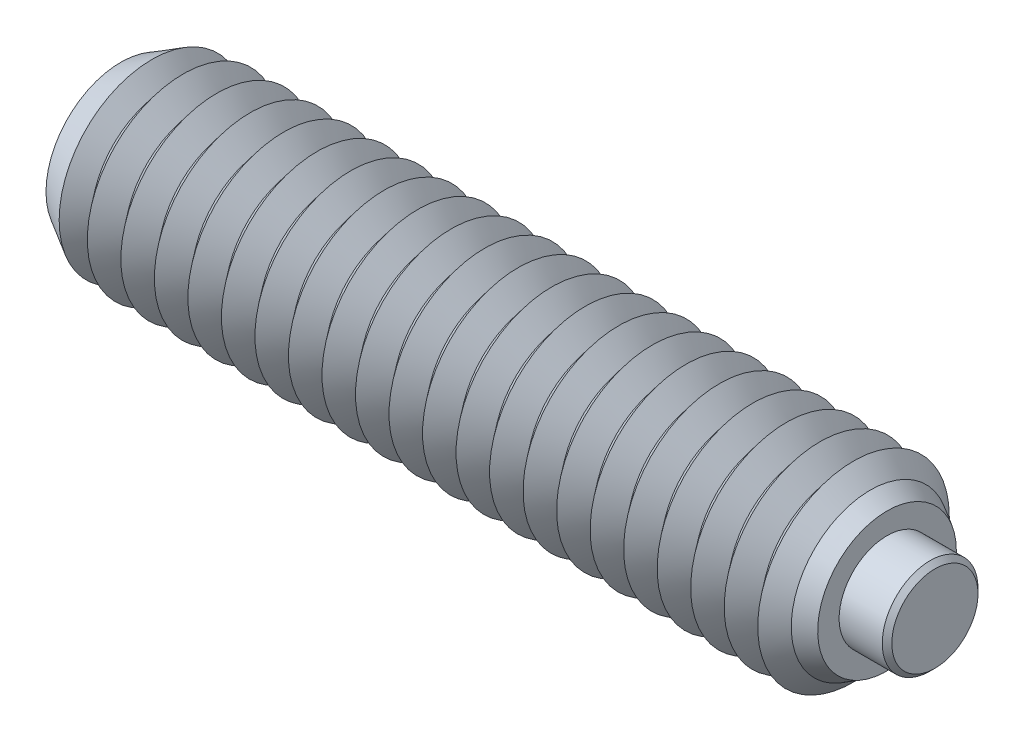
ISO-10303-21;
HEADER;
FILE_DESCRIPTION(('STEP AP214'),'2;1');
FILE_NAME('part.step','',(''),(''),'','','');
FILE_SCHEMA(('AUTOMOTIVE_DESIGN { 1 0 10303 214 1 1 1 1 }'));
ENDSEC;
DATA;
#1=APPLICATION_CONTEXT('core data for automotive mechanical design processes');
#2=APPLICATION_PROTOCOL_DEFINITION('international standard','automotive_design',2000,#1);
#3=PRODUCT_CONTEXT('',#1,'mechanical');
#4=PRODUCT('Part','Part','',(#3));
#5=PRODUCT_RELATED_PRODUCT_CATEGORY('part','',(#4));
#6=PRODUCT_DEFINITION_FORMATION('','',#4);
#7=PRODUCT_DEFINITION_CONTEXT('part definition',#1,'design');
#8=PRODUCT_DEFINITION('design','',#6,#7);
#9=PRODUCT_DEFINITION_SHAPE('','',#8);
#10=(LENGTH_UNIT() NAMED_UNIT(*) SI_UNIT(.MILLI.,.METRE.));
#11=(NAMED_UNIT(*) PLANE_ANGLE_UNIT() SI_UNIT($,.RADIAN.));
#12=(NAMED_UNIT(*) SI_UNIT($,.STERADIAN.) SOLID_ANGLE_UNIT());
#13=UNCERTAINTY_MEASURE_WITH_UNIT(LENGTH_MEASURE(1.E-05),#10,'distance_accuracy_value','');
#14=(GEOMETRIC_REPRESENTATION_CONTEXT(3) GLOBAL_UNCERTAINTY_ASSIGNED_CONTEXT((#13)) GLOBAL_UNIT_ASSIGNED_CONTEXT((#10,
#11,#12)) REPRESENTATION_CONTEXT('',''));
#15=CARTESIAN_POINT('',(0.,0.,0.));
#16=DIRECTION('',(0.,0.,1.));
#17=DIRECTION('',(1.,0.,0.));
#18=AXIS2_PLACEMENT_3D('',#15,#16,#17);
#19=CARTESIAN_POINT('',(1.35,0.,0.));
#20=DIRECTION('',(-1.,0.,0.));
#21=DIRECTION('',(0.,0.,1.));
#22=AXIS2_PLACEMENT_3D('',#19,#20,#21);
#23=CYLINDRICAL_SURFACE('',#22,1.);
#24=CARTESIAN_POINT('',(1.25,0.,0.));
#25=DIRECTION('',(1.,0.,0.));
#26=DIRECTION('',(0.,0.,-1.));
#27=AXIS2_PLACEMENT_3D('',#24,#25,#26);
#28=CIRCLE('',#27,1.);
#29=CARTESIAN_POINT('',(1.25,0.,-1.));
#30=VERTEX_POINT('',#29);
#31=EDGE_CURVE('P0_E10',#30,#30,#28,.F.);
#32=ORIENTED_EDGE('',*,*,#31,.T.);
#33=EDGE_LOOP('',(#32));
#34=FACE_BOUND('',#33,.T.);
#35=CARTESIAN_POINT('',(-0.65,0.,0.));
#36=DIRECTION('',(1.,0.,0.));
#37=DIRECTION('',(0.,0.,-1.));
#38=AXIS2_PLACEMENT_3D('',#35,#36,#37);
#39=CIRCLE('',#38,1.);
#40=CARTESIAN_POINT('',(-0.65,0.,-1.));
#41=VERTEX_POINT('',#40);
#42=EDGE_CURVE('P0_E25',#41,#41,#39,.T.);
#43=ORIENTED_EDGE('',*,*,#42,.T.);
#44=EDGE_LOOP('',(#43));
#45=FACE_BOUND('',#44,.T.);
#46=ADVANCED_FACE('P0_F14',(#34,#45),#23,.T.);
#47=CARTESIAN_POINT('',(1.35,0.,0.));
#48=DIRECTION('',(1.,0.,0.));
#49=DIRECTION('',(0.,0.,-1.));
#50=AXIS2_PLACEMENT_3D('',#47,#48,#49);
#51=PLANE('',#50);
#52=CARTESIAN_POINT('',(1.35,0.,0.));
#53=DIRECTION('',(1.,0.,0.));
#54=DIRECTION('',(0.,0.,-1.));
#55=AXIS2_PLACEMENT_3D('',#52,#53,#54);
#56=CIRCLE('',#55,0.899999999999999);
#57=CARTESIAN_POINT('',(1.35,0.,-0.899999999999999));
#58=VERTEX_POINT('',#57);
#59=EDGE_CURVE('P0_E21',#58,#58,#56,.T.);
#60=ORIENTED_EDGE('',*,*,#59,.T.);
#61=EDGE_LOOP('',(#60));
#62=FACE_BOUND('',#61,.T.);
#63=ADVANCED_FACE('P0_F35',(#62),#51,.T.);
#64=CARTESIAN_POINT('',(-0.65,0.,0.));
#65=DIRECTION('',(1.,0.,0.));
#66=DIRECTION('',(0.,0.,-1.));
#67=AXIS2_PLACEMENT_3D('',#64,#65,#66);
#68=PLANE('',#67);
#69=ORIENTED_EDGE('',*,*,#42,.F.);
#70=EDGE_LOOP('',(#69));
#71=FACE_BOUND('',#70,.T.);
#72=ADVANCED_FACE('P0_F33',(#71),#68,.F.);
#73=CARTESIAN_POINT('',(1.35,0.,0.));
#74=DIRECTION('',(-1.,0.,0.));
#75=DIRECTION('',(0.,0.,1.));
#76=AXIS2_PLACEMENT_3D('',#73,#74,#75);
#77=CONICAL_SURFACE('',#76,0.899999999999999,0.785398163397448);
#78=ORIENTED_EDGE('',*,*,#31,.F.);
#79=EDGE_LOOP('',(#78));
#80=FACE_BOUND('',#79,.T.);
#81=ORIENTED_EDGE('',*,*,#59,.F.);
#82=EDGE_LOOP('',(#81));
#83=FACE_BOUND('',#82,.T.);
#84=ADVANCED_FACE('P0_F16',(#80,#83),#77,.T.);
#85=CLOSED_SHELL('',(#46,#63,#72,#84));
#86=MANIFOLD_SOLID_BREP('P0_B1',#85);
#87=CARTESIAN_POINT('',(-15.05,0.,0.));
#88=DIRECTION('',(-1.,0.,0.));
#89=DIRECTION('',(0.,0.,1.));
#90=AXIS2_PLACEMENT_3D('',#87,#88,#89);
#91=CONICAL_SURFACE('',#90,2.,0.895664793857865);
#92=CARTESIAN_POINT('',(-14.7,0.,0.));
#93=DIRECTION('',(1.,0.,0.));
#94=DIRECTION('',(0.,0.,-1.));
#95=AXIS2_PLACEMENT_3D('',#92,#93,#94);
#96=CIRCLE('',#95,1.56285014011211);
#97=CARTESIAN_POINT('',(-14.7,0.,-1.56285014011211));
#98=VERTEX_POINT('',#97);
#99=EDGE_CURVE('P1_E1035',#98,#98,#96,.T.);
#100=ORIENTED_EDGE('',*,*,#99,.F.);
#101=EDGE_LOOP('',(#100));
#102=FACE_BOUND('',#101,.T.);
#103=CARTESIAN_POINT('',(-15.0003163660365,0.,0.));
#104=DIRECTION('',(1.,0.,0.));
#105=DIRECTION('',(0.,0.,-1.));
#106=AXIS2_PLACEMENT_3D('',#103,#104,#105);
#107=CIRCLE('',#106,1.93794516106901);
#108=CARTESIAN_POINT('',(-15.0003163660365,0.,-1.93794516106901));
#109=VERTEX_POINT('',#108);
#110=EDGE_CURVE('P1_E1038',#109,#109,#107,.F.);
#111=ORIENTED_EDGE('',*,*,#110,.F.);
#112=EDGE_LOOP('',(#111));
#113=FACE_BOUND('',#112,.T.);
#114=ADVANCED_FACE('P1_F15',(#102,#113),#91,.T.);
#115=CARTESIAN_POINT('',(-0.700000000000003,0.,0.));
#116=DIRECTION('',(1.,0.,0.));
#117=DIRECTION('',(0.,0.,-1.));
#118=AXIS2_PLACEMENT_3D('',#115,#116,#117);
#119=CONICAL_SURFACE('',#118,1.56285014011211,0.895664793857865);
#120=CARTESIAN_POINT('',(-0.350000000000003,0.,0.));
#121=DIRECTION('',(1.,0.,0.));
#122=DIRECTION('',(0.,0.,-1.));
#123=AXIS2_PLACEMENT_3D('',#120,#121,#122);
#124=CIRCLE('',#123,2.);
#125=CARTESIAN_POINT('',(-0.350000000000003,0.,-2.));
#126=VERTEX_POINT('',#125);
#127=EDGE_CURVE('P1_E911',#126,#126,#124,.T.);
#128=ORIENTED_EDGE('',*,*,#127,.F.);
#129=EDGE_LOOP('',(#128));
#130=FACE_BOUND('',#129,.T.);
#131=CARTESIAN_POINT('',(-0.700000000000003,0.,0.));
#132=DIRECTION('',(1.,0.,0.));
#133=DIRECTION('',(0.,0.,-1.));
#134=AXIS2_PLACEMENT_3D('',#131,#132,#133);
#135=CIRCLE('',#134,1.56285014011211);
#136=CARTESIAN_POINT('',(-0.700000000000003,0.,-1.56285014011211));
#137=VERTEX_POINT('',#136);
#138=EDGE_CURVE('P1_E912',#137,#137,#135,.T.);
#139=ORIENTED_EDGE('',*,*,#138,.T.);
#140=EDGE_LOOP('',(#139));
#141=FACE_BOUND('',#140,.T.);
#142=ADVANCED_FACE('P1_F222',(#130,#141),#119,.T.);
#143=CARTESIAN_POINT('',(-1.05,0.,0.));
#144=DIRECTION('',(-1.,0.,0.));
#145=DIRECTION('',(0.,0.,1.));
#146=AXIS2_PLACEMENT_3D('',#143,#144,#145);
#147=CONICAL_SURFACE('',#146,2.,0.895664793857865);
#148=ORIENTED_EDGE('',*,*,#138,.F.);
#149=EDGE_LOOP('',(#148));
#150=FACE_BOUND('',#149,.T.);
#151=CARTESIAN_POINT('',(-1.05,0.,0.));
#152=DIRECTION('',(1.,0.,0.));
#153=DIRECTION('',(0.,0.,-1.));
#154=AXIS2_PLACEMENT_3D('',#151,#152,#153);
#155=CIRCLE('',#154,2.);
#156=CARTESIAN_POINT('',(-1.05,0.,-2.));
#157=VERTEX_POINT('',#156);
#158=EDGE_CURVE('P1_E916',#157,#157,#155,.T.);
#159=ORIENTED_EDGE('',*,*,#158,.T.);
#160=EDGE_LOOP('',(#159));
#161=FACE_BOUND('',#160,.T.);
#162=ADVANCED_FACE('P1_F227',(#150,#161),#147,.T.);
#163=CARTESIAN_POINT('',(-0.65,0.,0.));
#164=DIRECTION('',(1.,0.,0.));
#165=DIRECTION('',(0.,1.,0.));
#166=AXIS2_PLACEMENT_3D('',#163,#164,#165);
#167=PLANE('',#166);
#168=CARTESIAN_POINT('',(-0.65,0.,0.));
#169=DIRECTION('',(1.,0.,0.));
#170=DIRECTION('',(0.,1.,0.));
#171=AXIS2_PLACEMENT_3D('',#168,#169,#170);
#172=CIRCLE('',#171,1.);
#173=CARTESIAN_POINT('',(-0.65,1.,0.));
#174=VERTEX_POINT('',#173);
#175=EDGE_CURVE('P1_E462',#174,#174,#172,.T.);
#176=ORIENTED_EDGE('',*,*,#175,.T.);
#177=EDGE_LOOP('',(#176));
#178=FACE_BOUND('',#177,.T.);
#179=ADVANCED_FACE('P1_F389',(#178),#167,.T.);
#180=CARTESIAN_POINT('',(-0.65,0.,0.));
#181=DIRECTION('',(1.,0.,0.));
#182=DIRECTION('',(0.,1.,0.));
#183=AXIS2_PLACEMENT_3D('',#180,#181,#182);
#184=CYLINDRICAL_SURFACE('',#183,1.);
#185=ORIENTED_EDGE('',*,*,#175,.F.);
#186=EDGE_LOOP('',(#185));
#187=FACE_BOUND('',#186,.T.);
#188=CARTESIAN_POINT('',(0.35,0.,0.));
#189=DIRECTION('',(1.,0.,0.));
#190=DIRECTION('',(0.,1.,0.));
#191=AXIS2_PLACEMENT_3D('',#188,#189,#190);
#192=CIRCLE('',#191,1.);
#193=CARTESIAN_POINT('',(0.35,1.,0.));
#194=VERTEX_POINT('',#193);
#195=EDGE_CURVE('P1_E465',#194,#194,#192,.T.);
#196=ORIENTED_EDGE('',*,*,#195,.T.);
#197=EDGE_LOOP('',(#196));
#198=FACE_BOUND('',#197,.T.);
#199=ADVANCED_FACE('P1_F209',(#187,#198),#184,.F.);
#200=CARTESIAN_POINT('',(0.35,1.44792740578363,0.));
#201=DIRECTION('',(1.,0.,0.));
#202=DIRECTION('',(0.,1.,0.));
#203=AXIS2_PLACEMENT_3D('',#200,#201,#202);
#204=PLANE('',#203);
#205=ORIENTED_EDGE('',*,*,#195,.F.);
#206=EDGE_LOOP('',(#205));
#207=FACE_BOUND('',#206,.T.);
#208=CARTESIAN_POINT('',(0.35,0.,0.));
#209=DIRECTION('',(1.,0.,0.));
#210=DIRECTION('',(0.,1.,0.));
#211=AXIS2_PLACEMENT_3D('',#208,#209,#210);
#212=CIRCLE('',#211,1.44792740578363);
#213=CARTESIAN_POINT('',(0.35,1.44792740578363,0.));
#214=VERTEX_POINT('',#213);
#215=EDGE_CURVE('P1_E121',#214,#214,#212,.T.);
#216=ORIENTED_EDGE('',*,*,#215,.T.);
#217=EDGE_LOOP('',(#216));
#218=FACE_BOUND('',#217,.T.);
#219=ADVANCED_FACE('P1_F206',(#207,#218),#204,.T.);
#220=CARTESIAN_POINT('',(0.35,0.,0.));
#221=DIRECTION('',(-1.,0.,0.));
#222=DIRECTION('',(0.,-1.,0.));
#223=AXIS2_PLACEMENT_3D('',#220,#221,#222);
#224=CONICAL_SURFACE('',#223,1.44792740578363,0.523598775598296);
#225=CARTESIAN_POINT('',(0.,0.,0.));
#226=DIRECTION('',(1.,0.,0.));
#227=DIRECTION('',(0.,0.,-1.));
#228=AXIS2_PLACEMENT_3D('',#225,#226,#227);
#229=CIRCLE('',#228,1.65);
#230=CARTESIAN_POINT('',(0.,0.,-1.65));
#231=VERTEX_POINT('',#230);
#232=EDGE_CURVE('P1_E453',#231,#231,#229,.T.);
#233=ORIENTED_EDGE('',*,*,#232,.T.);
#234=EDGE_LOOP('',(#233));
#235=FACE_BOUND('',#234,.T.);
#236=ORIENTED_EDGE('',*,*,#215,.F.);
#237=EDGE_LOOP('',(#236));
#238=FACE_BOUND('',#237,.T.);
#239=ADVANCED_FACE('P1_F203',(#235,#238),#224,.T.);
#240=CARTESIAN_POINT('',(0.,0.,0.));
#241=DIRECTION('',(-1.,0.,0.));
#242=DIRECTION('',(0.,0.,1.));
#243=AXIS2_PLACEMENT_3D('',#240,#241,#242);
#244=CONICAL_SURFACE('',#243,1.65,0.785398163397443);
#245=ORIENTED_EDGE('',*,*,#127,.T.);
#246=EDGE_LOOP('',(#245));
#247=FACE_BOUND('',#246,.T.);
#248=ORIENTED_EDGE('',*,*,#232,.F.);
#249=EDGE_LOOP('',(#248));
#250=FACE_BOUND('',#249,.T.);
#251=ADVANCED_FACE('P1_F17',(#247,#250),#244,.T.);
#252=CARTESIAN_POINT('',(-1.4,0.,0.));
#253=DIRECTION('',(1.,0.,0.));
#254=DIRECTION('',(0.,0.,-1.));
#255=AXIS2_PLACEMENT_3D('',#252,#253,#254);
#256=CONICAL_SURFACE('',#255,1.56285014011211,0.895664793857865);
#257=ORIENTED_EDGE('',*,*,#158,.F.);
#258=EDGE_LOOP('',(#257));
#259=FACE_BOUND('',#258,.T.);
#260=CARTESIAN_POINT('',(-1.4,0.,0.));
#261=DIRECTION('',(1.,0.,0.));
#262=DIRECTION('',(0.,0.,-1.));
#263=AXIS2_PLACEMENT_3D('',#260,#261,#262);
#264=CIRCLE('',#263,1.56285014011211);
#265=CARTESIAN_POINT('',(-1.4,0.,-1.56285014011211));
#266=VERTEX_POINT('',#265);
#267=EDGE_CURVE('P1_E921',#266,#266,#264,.T.);
#268=ORIENTED_EDGE('',*,*,#267,.T.);
#269=EDGE_LOOP('',(#268));
#270=FACE_BOUND('',#269,.T.);
#271=ADVANCED_FACE('P1_F383',(#259,#270),#256,.T.);
#272=CARTESIAN_POINT('',(-1.75,0.,0.));
#273=DIRECTION('',(-1.,0.,0.));
#274=DIRECTION('',(0.,0.,1.));
#275=AXIS2_PLACEMENT_3D('',#272,#273,#274);
#276=CONICAL_SURFACE('',#275,2.,0.895664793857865);
#277=ORIENTED_EDGE('',*,*,#267,.F.);
#278=EDGE_LOOP('',(#277));
#279=FACE_BOUND('',#278,.T.);
#280=CARTESIAN_POINT('',(-1.75,0.,0.));
#281=DIRECTION('',(1.,0.,0.));
#282=DIRECTION('',(0.,0.,-1.));
#283=AXIS2_PLACEMENT_3D('',#280,#281,#282);
#284=CIRCLE('',#283,2.);
#285=CARTESIAN_POINT('',(-1.75,0.,-2.));
#286=VERTEX_POINT('',#285);
#287=EDGE_CURVE('P1_E924',#286,#286,#284,.T.);
#288=ORIENTED_EDGE('',*,*,#287,.T.);
#289=EDGE_LOOP('',(#288));
#290=FACE_BOUND('',#289,.T.);
#291=ADVANCED_FACE('P1_F379',(#279,#290),#276,.T.);
#292=CARTESIAN_POINT('',(-2.1,0.,0.));
#293=DIRECTION('',(1.,0.,0.));
#294=DIRECTION('',(0.,0.,-1.));
#295=AXIS2_PLACEMENT_3D('',#292,#293,#294);
#296=CONICAL_SURFACE('',#295,1.56285014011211,0.895664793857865);
#297=ORIENTED_EDGE('',*,*,#287,.F.);
#298=EDGE_LOOP('',(#297));
#299=FACE_BOUND('',#298,.T.);
#300=CARTESIAN_POINT('',(-2.1,0.,0.));
#301=DIRECTION('',(1.,0.,0.));
#302=DIRECTION('',(0.,0.,-1.));
#303=AXIS2_PLACEMENT_3D('',#300,#301,#302);
#304=CIRCLE('',#303,1.56285014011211);
#305=CARTESIAN_POINT('',(-2.1,0.,-1.56285014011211));
#306=VERTEX_POINT('',#305);
#307=EDGE_CURVE('P1_E927',#306,#306,#304,.T.);
#308=ORIENTED_EDGE('',*,*,#307,.T.);
#309=EDGE_LOOP('',(#308));
#310=FACE_BOUND('',#309,.T.);
#311=ADVANCED_FACE('P1_F375',(#299,#310),#296,.T.);
#312=CARTESIAN_POINT('',(-2.45,0.,0.));
#313=DIRECTION('',(-1.,0.,0.));
#314=DIRECTION('',(0.,0.,1.));
#315=AXIS2_PLACEMENT_3D('',#312,#313,#314);
#316=CONICAL_SURFACE('',#315,2.,0.895664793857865);
#317=ORIENTED_EDGE('',*,*,#307,.F.);
#318=EDGE_LOOP('',(#317));
#319=FACE_BOUND('',#318,.T.);
#320=CARTESIAN_POINT('',(-2.45,0.,0.));
#321=DIRECTION('',(1.,0.,0.));
#322=DIRECTION('',(0.,0.,-1.));
#323=AXIS2_PLACEMENT_3D('',#320,#321,#322);
#324=CIRCLE('',#323,2.);
#325=CARTESIAN_POINT('',(-2.45,0.,-2.));
#326=VERTEX_POINT('',#325);
#327=EDGE_CURVE('P1_E930',#326,#326,#324,.T.);
#328=ORIENTED_EDGE('',*,*,#327,.T.);
#329=EDGE_LOOP('',(#328));
#330=FACE_BOUND('',#329,.T.);
#331=ADVANCED_FACE('P1_F371',(#319,#330),#316,.T.);
#332=CARTESIAN_POINT('',(-2.8,0.,0.));
#333=DIRECTION('',(1.,0.,0.));
#334=DIRECTION('',(0.,0.,-1.));
#335=AXIS2_PLACEMENT_3D('',#332,#333,#334);
#336=CONICAL_SURFACE('',#335,1.56285014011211,0.895664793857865);
#337=ORIENTED_EDGE('',*,*,#327,.F.);
#338=EDGE_LOOP('',(#337));
#339=FACE_BOUND('',#338,.T.);
#340=CARTESIAN_POINT('',(-2.8,0.,0.));
#341=DIRECTION('',(1.,0.,0.));
#342=DIRECTION('',(0.,0.,-1.));
#343=AXIS2_PLACEMENT_3D('',#340,#341,#342);
#344=CIRCLE('',#343,1.56285014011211);
#345=CARTESIAN_POINT('',(-2.8,0.,-1.56285014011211));
#346=VERTEX_POINT('',#345);
#347=EDGE_CURVE('P1_E933',#346,#346,#344,.T.);
#348=ORIENTED_EDGE('',*,*,#347,.T.);
#349=EDGE_LOOP('',(#348));
#350=FACE_BOUND('',#349,.T.);
#351=ADVANCED_FACE('P1_F367',(#339,#350),#336,.T.);
#352=CARTESIAN_POINT('',(-3.15,0.,0.));
#353=DIRECTION('',(-1.,0.,0.));
#354=DIRECTION('',(0.,0.,1.));
#355=AXIS2_PLACEMENT_3D('',#352,#353,#354);
#356=CONICAL_SURFACE('',#355,2.,0.895664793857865);
#357=ORIENTED_EDGE('',*,*,#347,.F.);
#358=EDGE_LOOP('',(#357));
#359=FACE_BOUND('',#358,.T.);
#360=CARTESIAN_POINT('',(-3.15,0.,0.));
#361=DIRECTION('',(1.,0.,0.));
#362=DIRECTION('',(0.,0.,-1.));
#363=AXIS2_PLACEMENT_3D('',#360,#361,#362);
#364=CIRCLE('',#363,2.);
#365=CARTESIAN_POINT('',(-3.15,0.,-2.));
#366=VERTEX_POINT('',#365);
#367=EDGE_CURVE('P1_E936',#366,#366,#364,.T.);
#368=ORIENTED_EDGE('',*,*,#367,.T.);
#369=EDGE_LOOP('',(#368));
#370=FACE_BOUND('',#369,.T.);
#371=ADVANCED_FACE('P1_F363',(#359,#370),#356,.T.);
#372=CARTESIAN_POINT('',(-3.5,0.,0.));
#373=DIRECTION('',(1.,0.,0.));
#374=DIRECTION('',(0.,0.,-1.));
#375=AXIS2_PLACEMENT_3D('',#372,#373,#374);
#376=CONICAL_SURFACE('',#375,1.56285014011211,0.895664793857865);
#377=ORIENTED_EDGE('',*,*,#367,.F.);
#378=EDGE_LOOP('',(#377));
#379=FACE_BOUND('',#378,.T.);
#380=CARTESIAN_POINT('',(-3.5,0.,0.));
#381=DIRECTION('',(1.,0.,0.));
#382=DIRECTION('',(0.,0.,-1.));
#383=AXIS2_PLACEMENT_3D('',#380,#381,#382);
#384=CIRCLE('',#383,1.56285014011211);
#385=CARTESIAN_POINT('',(-3.5,0.,-1.56285014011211));
#386=VERTEX_POINT('',#385);
#387=EDGE_CURVE('P1_E939',#386,#386,#384,.T.);
#388=ORIENTED_EDGE('',*,*,#387,.T.);
#389=EDGE_LOOP('',(#388));
#390=FACE_BOUND('',#389,.T.);
#391=ADVANCED_FACE('P1_F359',(#379,#390),#376,.T.);
#392=CARTESIAN_POINT('',(-3.85,0.,0.));
#393=DIRECTION('',(-1.,0.,0.));
#394=DIRECTION('',(0.,0.,1.));
#395=AXIS2_PLACEMENT_3D('',#392,#393,#394);
#396=CONICAL_SURFACE('',#395,2.,0.895664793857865);
#397=ORIENTED_EDGE('',*,*,#387,.F.);
#398=EDGE_LOOP('',(#397));
#399=FACE_BOUND('',#398,.T.);
#400=CARTESIAN_POINT('',(-3.85,0.,0.));
#401=DIRECTION('',(1.,0.,0.));
#402=DIRECTION('',(0.,0.,-1.));
#403=AXIS2_PLACEMENT_3D('',#400,#401,#402);
#404=CIRCLE('',#403,2.);
#405=CARTESIAN_POINT('',(-3.85,0.,-2.));
#406=VERTEX_POINT('',#405);
#407=EDGE_CURVE('P1_E942',#406,#406,#404,.T.);
#408=ORIENTED_EDGE('',*,*,#407,.T.);
#409=EDGE_LOOP('',(#408));
#410=FACE_BOUND('',#409,.T.);
#411=ADVANCED_FACE('P1_F355',(#399,#410),#396,.T.);
#412=CARTESIAN_POINT('',(-4.2,0.,0.));
#413=DIRECTION('',(1.,0.,0.));
#414=DIRECTION('',(0.,0.,-1.));
#415=AXIS2_PLACEMENT_3D('',#412,#413,#414);
#416=CONICAL_SURFACE('',#415,1.56285014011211,0.895664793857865);
#417=ORIENTED_EDGE('',*,*,#407,.F.);
#418=EDGE_LOOP('',(#417));
#419=FACE_BOUND('',#418,.T.);
#420=CARTESIAN_POINT('',(-4.2,0.,0.));
#421=DIRECTION('',(1.,0.,0.));
#422=DIRECTION('',(0.,0.,-1.));
#423=AXIS2_PLACEMENT_3D('',#420,#421,#422);
#424=CIRCLE('',#423,1.56285014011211);
#425=CARTESIAN_POINT('',(-4.2,0.,-1.56285014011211));
#426=VERTEX_POINT('',#425);
#427=EDGE_CURVE('P1_E945',#426,#426,#424,.T.);
#428=ORIENTED_EDGE('',*,*,#427,.T.);
#429=EDGE_LOOP('',(#428));
#430=FACE_BOUND('',#429,.T.);
#431=ADVANCED_FACE('P1_F351',(#419,#430),#416,.T.);
#432=CARTESIAN_POINT('',(-4.55,0.,0.));
#433=DIRECTION('',(-1.,0.,0.));
#434=DIRECTION('',(0.,0.,1.));
#435=AXIS2_PLACEMENT_3D('',#432,#433,#434);
#436=CONICAL_SURFACE('',#435,2.,0.895664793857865);
#437=ORIENTED_EDGE('',*,*,#427,.F.);
#438=EDGE_LOOP('',(#437));
#439=FACE_BOUND('',#438,.T.);
#440=CARTESIAN_POINT('',(-4.55,0.,0.));
#441=DIRECTION('',(1.,0.,0.));
#442=DIRECTION('',(0.,0.,-1.));
#443=AXIS2_PLACEMENT_3D('',#440,#441,#442);
#444=CIRCLE('',#443,2.);
#445=CARTESIAN_POINT('',(-4.55,0.,-2.));
#446=VERTEX_POINT('',#445);
#447=EDGE_CURVE('P1_E948',#446,#446,#444,.T.);
#448=ORIENTED_EDGE('',*,*,#447,.T.);
#449=EDGE_LOOP('',(#448));
#450=FACE_BOUND('',#449,.T.);
#451=ADVANCED_FACE('P1_F347',(#439,#450),#436,.T.);
#452=CARTESIAN_POINT('',(-4.9,0.,0.));
#453=DIRECTION('',(1.,0.,0.));
#454=DIRECTION('',(0.,0.,-1.));
#455=AXIS2_PLACEMENT_3D('',#452,#453,#454);
#456=CONICAL_SURFACE('',#455,1.56285014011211,0.895664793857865);
#457=ORIENTED_EDGE('',*,*,#447,.F.);
#458=EDGE_LOOP('',(#457));
#459=FACE_BOUND('',#458,.T.);
#460=CARTESIAN_POINT('',(-4.9,0.,0.));
#461=DIRECTION('',(1.,0.,0.));
#462=DIRECTION('',(0.,0.,-1.));
#463=AXIS2_PLACEMENT_3D('',#460,#461,#462);
#464=CIRCLE('',#463,1.56285014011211);
#465=CARTESIAN_POINT('',(-4.9,0.,-1.56285014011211));
#466=VERTEX_POINT('',#465);
#467=EDGE_CURVE('P1_E951',#466,#466,#464,.T.);
#468=ORIENTED_EDGE('',*,*,#467,.T.);
#469=EDGE_LOOP('',(#468));
#470=FACE_BOUND('',#469,.T.);
#471=ADVANCED_FACE('P1_F343',(#459,#470),#456,.T.);
#472=CARTESIAN_POINT('',(-5.25,0.,0.));
#473=DIRECTION('',(-1.,0.,0.));
#474=DIRECTION('',(0.,0.,1.));
#475=AXIS2_PLACEMENT_3D('',#472,#473,#474);
#476=CONICAL_SURFACE('',#475,2.,0.895664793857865);
#477=ORIENTED_EDGE('',*,*,#467,.F.);
#478=EDGE_LOOP('',(#477));
#479=FACE_BOUND('',#478,.T.);
#480=CARTESIAN_POINT('',(-5.25,0.,0.));
#481=DIRECTION('',(1.,0.,0.));
#482=DIRECTION('',(0.,0.,-1.));
#483=AXIS2_PLACEMENT_3D('',#480,#481,#482);
#484=CIRCLE('',#483,2.);
#485=CARTESIAN_POINT('',(-5.25,0.,-2.));
#486=VERTEX_POINT('',#485);
#487=EDGE_CURVE('P1_E954',#486,#486,#484,.T.);
#488=ORIENTED_EDGE('',*,*,#487,.T.);
#489=EDGE_LOOP('',(#488));
#490=FACE_BOUND('',#489,.T.);
#491=ADVANCED_FACE('P1_F339',(#479,#490),#476,.T.);
#492=CARTESIAN_POINT('',(-5.6,0.,0.));
#493=DIRECTION('',(1.,0.,0.));
#494=DIRECTION('',(0.,0.,-1.));
#495=AXIS2_PLACEMENT_3D('',#492,#493,#494);
#496=CONICAL_SURFACE('',#495,1.56285014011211,0.895664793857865);
#497=ORIENTED_EDGE('',*,*,#487,.F.);
#498=EDGE_LOOP('',(#497));
#499=FACE_BOUND('',#498,.T.);
#500=CARTESIAN_POINT('',(-5.6,0.,0.));
#501=DIRECTION('',(1.,0.,0.));
#502=DIRECTION('',(0.,0.,-1.));
#503=AXIS2_PLACEMENT_3D('',#500,#501,#502);
#504=CIRCLE('',#503,1.56285014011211);
#505=CARTESIAN_POINT('',(-5.6,0.,-1.56285014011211));
#506=VERTEX_POINT('',#505);
#507=EDGE_CURVE('P1_E957',#506,#506,#504,.T.);
#508=ORIENTED_EDGE('',*,*,#507,.T.);
#509=EDGE_LOOP('',(#508));
#510=FACE_BOUND('',#509,.T.);
#511=ADVANCED_FACE('P1_F335',(#499,#510),#496,.T.);
#512=CARTESIAN_POINT('',(-5.95,0.,0.));
#513=DIRECTION('',(-1.,0.,0.));
#514=DIRECTION('',(0.,0.,1.));
#515=AXIS2_PLACEMENT_3D('',#512,#513,#514);
#516=CONICAL_SURFACE('',#515,2.,0.895664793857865);
#517=ORIENTED_EDGE('',*,*,#507,.F.);
#518=EDGE_LOOP('',(#517));
#519=FACE_BOUND('',#518,.T.);
#520=CARTESIAN_POINT('',(-5.95,0.,0.));
#521=DIRECTION('',(1.,0.,0.));
#522=DIRECTION('',(0.,0.,-1.));
#523=AXIS2_PLACEMENT_3D('',#520,#521,#522);
#524=CIRCLE('',#523,2.);
#525=CARTESIAN_POINT('',(-5.95,0.,-2.));
#526=VERTEX_POINT('',#525);
#527=EDGE_CURVE('P1_E960',#526,#526,#524,.T.);
#528=ORIENTED_EDGE('',*,*,#527,.T.);
#529=EDGE_LOOP('',(#528));
#530=FACE_BOUND('',#529,.T.);
#531=ADVANCED_FACE('P1_F331',(#519,#530),#516,.T.);
#532=CARTESIAN_POINT('',(-6.3,0.,0.));
#533=DIRECTION('',(1.,0.,0.));
#534=DIRECTION('',(0.,0.,-1.));
#535=AXIS2_PLACEMENT_3D('',#532,#533,#534);
#536=CONICAL_SURFACE('',#535,1.56285014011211,0.895664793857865);
#537=ORIENTED_EDGE('',*,*,#527,.F.);
#538=EDGE_LOOP('',(#537));
#539=FACE_BOUND('',#538,.T.);
#540=CARTESIAN_POINT('',(-6.3,0.,0.));
#541=DIRECTION('',(1.,0.,0.));
#542=DIRECTION('',(0.,0.,-1.));
#543=AXIS2_PLACEMENT_3D('',#540,#541,#542);
#544=CIRCLE('',#543,1.56285014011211);
#545=CARTESIAN_POINT('',(-6.3,0.,-1.56285014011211));
#546=VERTEX_POINT('',#545);
#547=EDGE_CURVE('P1_E963',#546,#546,#544,.T.);
#548=ORIENTED_EDGE('',*,*,#547,.T.);
#549=EDGE_LOOP('',(#548));
#550=FACE_BOUND('',#549,.T.);
#551=ADVANCED_FACE('P1_F327',(#539,#550),#536,.T.);
#552=CARTESIAN_POINT('',(-6.65,0.,0.));
#553=DIRECTION('',(-1.,0.,0.));
#554=DIRECTION('',(0.,0.,1.));
#555=AXIS2_PLACEMENT_3D('',#552,#553,#554);
#556=CONICAL_SURFACE('',#555,2.,0.895664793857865);
#557=ORIENTED_EDGE('',*,*,#547,.F.);
#558=EDGE_LOOP('',(#557));
#559=FACE_BOUND('',#558,.T.);
#560=CARTESIAN_POINT('',(-6.65,0.,0.));
#561=DIRECTION('',(1.,0.,0.));
#562=DIRECTION('',(0.,0.,-1.));
#563=AXIS2_PLACEMENT_3D('',#560,#561,#562);
#564=CIRCLE('',#563,2.);
#565=CARTESIAN_POINT('',(-6.65,0.,-2.));
#566=VERTEX_POINT('',#565);
#567=EDGE_CURVE('P1_E966',#566,#566,#564,.T.);
#568=ORIENTED_EDGE('',*,*,#567,.T.);
#569=EDGE_LOOP('',(#568));
#570=FACE_BOUND('',#569,.T.);
#571=ADVANCED_FACE('P1_F323',(#559,#570),#556,.T.);
#572=CARTESIAN_POINT('',(-7.,0.,0.));
#573=DIRECTION('',(1.,0.,0.));
#574=DIRECTION('',(0.,0.,-1.));
#575=AXIS2_PLACEMENT_3D('',#572,#573,#574);
#576=CONICAL_SURFACE('',#575,1.56285014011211,0.895664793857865);
#577=ORIENTED_EDGE('',*,*,#567,.F.);
#578=EDGE_LOOP('',(#577));
#579=FACE_BOUND('',#578,.T.);
#580=CARTESIAN_POINT('',(-7.,0.,0.));
#581=DIRECTION('',(1.,0.,0.));
#582=DIRECTION('',(0.,0.,-1.));
#583=AXIS2_PLACEMENT_3D('',#580,#581,#582);
#584=CIRCLE('',#583,1.56285014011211);
#585=CARTESIAN_POINT('',(-7.,0.,-1.56285014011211));
#586=VERTEX_POINT('',#585);
#587=EDGE_CURVE('P1_E969',#586,#586,#584,.T.);
#588=ORIENTED_EDGE('',*,*,#587,.T.);
#589=EDGE_LOOP('',(#588));
#590=FACE_BOUND('',#589,.T.);
#591=ADVANCED_FACE('P1_F319',(#579,#590),#576,.T.);
#592=CARTESIAN_POINT('',(-7.35,0.,0.));
#593=DIRECTION('',(-1.,0.,0.));
#594=DIRECTION('',(0.,0.,1.));
#595=AXIS2_PLACEMENT_3D('',#592,#593,#594);
#596=CONICAL_SURFACE('',#595,2.,0.895664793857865);
#597=ORIENTED_EDGE('',*,*,#587,.F.);
#598=EDGE_LOOP('',(#597));
#599=FACE_BOUND('',#598,.T.);
#600=CARTESIAN_POINT('',(-7.35,0.,0.));
#601=DIRECTION('',(1.,0.,0.));
#602=DIRECTION('',(0.,0.,-1.));
#603=AXIS2_PLACEMENT_3D('',#600,#601,#602);
#604=CIRCLE('',#603,2.);
#605=CARTESIAN_POINT('',(-7.35,0.,-2.));
#606=VERTEX_POINT('',#605);
#607=EDGE_CURVE('P1_E972',#606,#606,#604,.T.);
#608=ORIENTED_EDGE('',*,*,#607,.T.);
#609=EDGE_LOOP('',(#608));
#610=FACE_BOUND('',#609,.T.);
#611=ADVANCED_FACE('P1_F315',(#599,#610),#596,.T.);
#612=CARTESIAN_POINT('',(-7.7,0.,0.));
#613=DIRECTION('',(1.,0.,0.));
#614=DIRECTION('',(0.,0.,-1.));
#615=AXIS2_PLACEMENT_3D('',#612,#613,#614);
#616=CONICAL_SURFACE('',#615,1.56285014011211,0.895664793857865);
#617=ORIENTED_EDGE('',*,*,#607,.F.);
#618=EDGE_LOOP('',(#617));
#619=FACE_BOUND('',#618,.T.);
#620=CARTESIAN_POINT('',(-7.7,0.,0.));
#621=DIRECTION('',(1.,0.,0.));
#622=DIRECTION('',(0.,0.,-1.));
#623=AXIS2_PLACEMENT_3D('',#620,#621,#622);
#624=CIRCLE('',#623,1.56285014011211);
#625=CARTESIAN_POINT('',(-7.7,0.,-1.56285014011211));
#626=VERTEX_POINT('',#625);
#627=EDGE_CURVE('P1_E975',#626,#626,#624,.T.);
#628=ORIENTED_EDGE('',*,*,#627,.T.);
#629=EDGE_LOOP('',(#628));
#630=FACE_BOUND('',#629,.T.);
#631=ADVANCED_FACE('P1_F311',(#619,#630),#616,.T.);
#632=CARTESIAN_POINT('',(-8.05,0.,0.));
#633=DIRECTION('',(-1.,0.,0.));
#634=DIRECTION('',(0.,0.,1.));
#635=AXIS2_PLACEMENT_3D('',#632,#633,#634);
#636=CONICAL_SURFACE('',#635,2.,0.895664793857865);
#637=ORIENTED_EDGE('',*,*,#627,.F.);
#638=EDGE_LOOP('',(#637));
#639=FACE_BOUND('',#638,.T.);
#640=CARTESIAN_POINT('',(-8.05,0.,0.));
#641=DIRECTION('',(1.,0.,0.));
#642=DIRECTION('',(0.,0.,-1.));
#643=AXIS2_PLACEMENT_3D('',#640,#641,#642);
#644=CIRCLE('',#643,2.);
#645=CARTESIAN_POINT('',(-8.05,0.,-2.));
#646=VERTEX_POINT('',#645);
#647=EDGE_CURVE('P1_E978',#646,#646,#644,.T.);
#648=ORIENTED_EDGE('',*,*,#647,.T.);
#649=EDGE_LOOP('',(#648));
#650=FACE_BOUND('',#649,.T.);
#651=ADVANCED_FACE('P1_F307',(#639,#650),#636,.T.);
#652=CARTESIAN_POINT('',(-8.4,0.,0.));
#653=DIRECTION('',(1.,0.,0.));
#654=DIRECTION('',(0.,0.,-1.));
#655=AXIS2_PLACEMENT_3D('',#652,#653,#654);
#656=CONICAL_SURFACE('',#655,1.56285014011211,0.895664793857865);
#657=ORIENTED_EDGE('',*,*,#647,.F.);
#658=EDGE_LOOP('',(#657));
#659=FACE_BOUND('',#658,.T.);
#660=CARTESIAN_POINT('',(-8.4,0.,0.));
#661=DIRECTION('',(1.,0.,0.));
#662=DIRECTION('',(0.,0.,-1.));
#663=AXIS2_PLACEMENT_3D('',#660,#661,#662);
#664=CIRCLE('',#663,1.56285014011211);
#665=CARTESIAN_POINT('',(-8.4,0.,-1.56285014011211));
#666=VERTEX_POINT('',#665);
#667=EDGE_CURVE('P1_E981',#666,#666,#664,.T.);
#668=ORIENTED_EDGE('',*,*,#667,.T.);
#669=EDGE_LOOP('',(#668));
#670=FACE_BOUND('',#669,.T.);
#671=ADVANCED_FACE('P1_F303',(#659,#670),#656,.T.);
#672=CARTESIAN_POINT('',(-8.75,0.,0.));
#673=DIRECTION('',(-1.,0.,0.));
#674=DIRECTION('',(0.,0.,1.));
#675=AXIS2_PLACEMENT_3D('',#672,#673,#674);
#676=CONICAL_SURFACE('',#675,2.,0.895664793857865);
#677=ORIENTED_EDGE('',*,*,#667,.F.);
#678=EDGE_LOOP('',(#677));
#679=FACE_BOUND('',#678,.T.);
#680=CARTESIAN_POINT('',(-8.75,0.,0.));
#681=DIRECTION('',(1.,0.,0.));
#682=DIRECTION('',(0.,0.,-1.));
#683=AXIS2_PLACEMENT_3D('',#680,#681,#682);
#684=CIRCLE('',#683,2.);
#685=CARTESIAN_POINT('',(-8.75,0.,-2.));
#686=VERTEX_POINT('',#685);
#687=EDGE_CURVE('P1_E984',#686,#686,#684,.T.);
#688=ORIENTED_EDGE('',*,*,#687,.T.);
#689=EDGE_LOOP('',(#688));
#690=FACE_BOUND('',#689,.T.);
#691=ADVANCED_FACE('P1_F299',(#679,#690),#676,.T.);
#692=CARTESIAN_POINT('',(-9.1,0.,0.));
#693=DIRECTION('',(1.,0.,0.));
#694=DIRECTION('',(0.,0.,-1.));
#695=AXIS2_PLACEMENT_3D('',#692,#693,#694);
#696=CONICAL_SURFACE('',#695,1.56285014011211,0.895664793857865);
#697=ORIENTED_EDGE('',*,*,#687,.F.);
#698=EDGE_LOOP('',(#697));
#699=FACE_BOUND('',#698,.T.);
#700=CARTESIAN_POINT('',(-9.1,0.,0.));
#701=DIRECTION('',(1.,0.,0.));
#702=DIRECTION('',(0.,0.,-1.));
#703=AXIS2_PLACEMENT_3D('',#700,#701,#702);
#704=CIRCLE('',#703,1.56285014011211);
#705=CARTESIAN_POINT('',(-9.1,0.,-1.56285014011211));
#706=VERTEX_POINT('',#705);
#707=EDGE_CURVE('P1_E987',#706,#706,#704,.T.);
#708=ORIENTED_EDGE('',*,*,#707,.T.);
#709=EDGE_LOOP('',(#708));
#710=FACE_BOUND('',#709,.T.);
#711=ADVANCED_FACE('P1_F295',(#699,#710),#696,.T.);
#712=CARTESIAN_POINT('',(-9.45,0.,0.));
#713=DIRECTION('',(-1.,0.,0.));
#714=DIRECTION('',(0.,0.,1.));
#715=AXIS2_PLACEMENT_3D('',#712,#713,#714);
#716=CONICAL_SURFACE('',#715,2.,0.895664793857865);
#717=ORIENTED_EDGE('',*,*,#707,.F.);
#718=EDGE_LOOP('',(#717));
#719=FACE_BOUND('',#718,.T.);
#720=CARTESIAN_POINT('',(-9.45,0.,0.));
#721=DIRECTION('',(1.,0.,0.));
#722=DIRECTION('',(0.,0.,-1.));
#723=AXIS2_PLACEMENT_3D('',#720,#721,#722);
#724=CIRCLE('',#723,2.);
#725=CARTESIAN_POINT('',(-9.45,0.,-2.));
#726=VERTEX_POINT('',#725);
#727=EDGE_CURVE('P1_E990',#726,#726,#724,.T.);
#728=ORIENTED_EDGE('',*,*,#727,.T.);
#729=EDGE_LOOP('',(#728));
#730=FACE_BOUND('',#729,.T.);
#731=ADVANCED_FACE('P1_F291',(#719,#730),#716,.T.);
#732=CARTESIAN_POINT('',(-9.8,0.,0.));
#733=DIRECTION('',(1.,0.,0.));
#734=DIRECTION('',(0.,0.,-1.));
#735=AXIS2_PLACEMENT_3D('',#732,#733,#734);
#736=CONICAL_SURFACE('',#735,1.56285014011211,0.895664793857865);
#737=ORIENTED_EDGE('',*,*,#727,.F.);
#738=EDGE_LOOP('',(#737));
#739=FACE_BOUND('',#738,.T.);
#740=CARTESIAN_POINT('',(-9.8,0.,0.));
#741=DIRECTION('',(1.,0.,0.));
#742=DIRECTION('',(0.,0.,-1.));
#743=AXIS2_PLACEMENT_3D('',#740,#741,#742);
#744=CIRCLE('',#743,1.56285014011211);
#745=CARTESIAN_POINT('',(-9.8,0.,-1.56285014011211));
#746=VERTEX_POINT('',#745);
#747=EDGE_CURVE('P1_E993',#746,#746,#744,.T.);
#748=ORIENTED_EDGE('',*,*,#747,.T.);
#749=EDGE_LOOP('',(#748));
#750=FACE_BOUND('',#749,.T.);
#751=ADVANCED_FACE('P1_F287',(#739,#750),#736,.T.);
#752=CARTESIAN_POINT('',(-10.15,0.,0.));
#753=DIRECTION('',(-1.,0.,0.));
#754=DIRECTION('',(0.,0.,1.));
#755=AXIS2_PLACEMENT_3D('',#752,#753,#754);
#756=CONICAL_SURFACE('',#755,2.,0.895664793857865);
#757=ORIENTED_EDGE('',*,*,#747,.F.);
#758=EDGE_LOOP('',(#757));
#759=FACE_BOUND('',#758,.T.);
#760=CARTESIAN_POINT('',(-10.15,0.,0.));
#761=DIRECTION('',(1.,0.,0.));
#762=DIRECTION('',(0.,0.,-1.));
#763=AXIS2_PLACEMENT_3D('',#760,#761,#762);
#764=CIRCLE('',#763,2.);
#765=CARTESIAN_POINT('',(-10.15,0.,-2.));
#766=VERTEX_POINT('',#765);
#767=EDGE_CURVE('P1_E996',#766,#766,#764,.T.);
#768=ORIENTED_EDGE('',*,*,#767,.T.);
#769=EDGE_LOOP('',(#768));
#770=FACE_BOUND('',#769,.T.);
#771=ADVANCED_FACE('P1_F283',(#759,#770),#756,.T.);
#772=CARTESIAN_POINT('',(-10.5,0.,0.));
#773=DIRECTION('',(1.,0.,0.));
#774=DIRECTION('',(0.,0.,-1.));
#775=AXIS2_PLACEMENT_3D('',#772,#773,#774);
#776=CONICAL_SURFACE('',#775,1.56285014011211,0.895664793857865);
#777=ORIENTED_EDGE('',*,*,#767,.F.);
#778=EDGE_LOOP('',(#777));
#779=FACE_BOUND('',#778,.T.);
#780=CARTESIAN_POINT('',(-10.5,0.,0.));
#781=DIRECTION('',(1.,0.,0.));
#782=DIRECTION('',(0.,0.,-1.));
#783=AXIS2_PLACEMENT_3D('',#780,#781,#782);
#784=CIRCLE('',#783,1.56285014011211);
#785=CARTESIAN_POINT('',(-10.5,0.,-1.56285014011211));
#786=VERTEX_POINT('',#785);
#787=EDGE_CURVE('P1_E999',#786,#786,#784,.T.);
#788=ORIENTED_EDGE('',*,*,#787,.T.);
#789=EDGE_LOOP('',(#788));
#790=FACE_BOUND('',#789,.T.);
#791=ADVANCED_FACE('P1_F279',(#779,#790),#776,.T.);
#792=CARTESIAN_POINT('',(-10.85,0.,0.));
#793=DIRECTION('',(-1.,0.,0.));
#794=DIRECTION('',(0.,0.,1.));
#795=AXIS2_PLACEMENT_3D('',#792,#793,#794);
#796=CONICAL_SURFACE('',#795,2.,0.895664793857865);
#797=ORIENTED_EDGE('',*,*,#787,.F.);
#798=EDGE_LOOP('',(#797));
#799=FACE_BOUND('',#798,.T.);
#800=CARTESIAN_POINT('',(-10.85,0.,0.));
#801=DIRECTION('',(1.,0.,0.));
#802=DIRECTION('',(0.,0.,-1.));
#803=AXIS2_PLACEMENT_3D('',#800,#801,#802);
#804=CIRCLE('',#803,2.);
#805=CARTESIAN_POINT('',(-10.85,0.,-2.));
#806=VERTEX_POINT('',#805);
#807=EDGE_CURVE('P1_E1002',#806,#806,#804,.T.);
#808=ORIENTED_EDGE('',*,*,#807,.T.);
#809=EDGE_LOOP('',(#808));
#810=FACE_BOUND('',#809,.T.);
#811=ADVANCED_FACE('P1_F275',(#799,#810),#796,.T.);
#812=CARTESIAN_POINT('',(-11.2,0.,0.));
#813=DIRECTION('',(1.,0.,0.));
#814=DIRECTION('',(0.,0.,-1.));
#815=AXIS2_PLACEMENT_3D('',#812,#813,#814);
#816=CONICAL_SURFACE('',#815,1.56285014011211,0.895664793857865);
#817=ORIENTED_EDGE('',*,*,#807,.F.);
#818=EDGE_LOOP('',(#817));
#819=FACE_BOUND('',#818,.T.);
#820=CARTESIAN_POINT('',(-11.2,0.,0.));
#821=DIRECTION('',(1.,0.,0.));
#822=DIRECTION('',(0.,0.,-1.));
#823=AXIS2_PLACEMENT_3D('',#820,#821,#822);
#824=CIRCLE('',#823,1.56285014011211);
#825=CARTESIAN_POINT('',(-11.2,0.,-1.56285014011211));
#826=VERTEX_POINT('',#825);
#827=EDGE_CURVE('P1_E1005',#826,#826,#824,.T.);
#828=ORIENTED_EDGE('',*,*,#827,.T.);
#829=EDGE_LOOP('',(#828));
#830=FACE_BOUND('',#829,.T.);
#831=ADVANCED_FACE('P1_F271',(#819,#830),#816,.T.);
#832=CARTESIAN_POINT('',(-11.55,0.,0.));
#833=DIRECTION('',(-1.,0.,0.));
#834=DIRECTION('',(0.,0.,1.));
#835=AXIS2_PLACEMENT_3D('',#832,#833,#834);
#836=CONICAL_SURFACE('',#835,2.,0.895664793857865);
#837=ORIENTED_EDGE('',*,*,#827,.F.);
#838=EDGE_LOOP('',(#837));
#839=FACE_BOUND('',#838,.T.);
#840=CARTESIAN_POINT('',(-11.55,0.,0.));
#841=DIRECTION('',(1.,0.,0.));
#842=DIRECTION('',(0.,0.,-1.));
#843=AXIS2_PLACEMENT_3D('',#840,#841,#842);
#844=CIRCLE('',#843,2.);
#845=CARTESIAN_POINT('',(-11.55,0.,-2.));
#846=VERTEX_POINT('',#845);
#847=EDGE_CURVE('P1_E1008',#846,#846,#844,.T.);
#848=ORIENTED_EDGE('',*,*,#847,.T.);
#849=EDGE_LOOP('',(#848));
#850=FACE_BOUND('',#849,.T.);
#851=ADVANCED_FACE('P1_F267',(#839,#850),#836,.T.);
#852=CARTESIAN_POINT('',(-11.9,0.,0.));
#853=DIRECTION('',(1.,0.,0.));
#854=DIRECTION('',(0.,0.,-1.));
#855=AXIS2_PLACEMENT_3D('',#852,#853,#854);
#856=CONICAL_SURFACE('',#855,1.56285014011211,0.895664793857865);
#857=ORIENTED_EDGE('',*,*,#847,.F.);
#858=EDGE_LOOP('',(#857));
#859=FACE_BOUND('',#858,.T.);
#860=CARTESIAN_POINT('',(-11.9,0.,0.));
#861=DIRECTION('',(1.,0.,0.));
#862=DIRECTION('',(0.,0.,-1.));
#863=AXIS2_PLACEMENT_3D('',#860,#861,#862);
#864=CIRCLE('',#863,1.56285014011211);
#865=CARTESIAN_POINT('',(-11.9,0.,-1.56285014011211));
#866=VERTEX_POINT('',#865);
#867=EDGE_CURVE('P1_E1011',#866,#866,#864,.T.);
#868=ORIENTED_EDGE('',*,*,#867,.T.);
#869=EDGE_LOOP('',(#868));
#870=FACE_BOUND('',#869,.T.);
#871=ADVANCED_FACE('P1_F263',(#859,#870),#856,.T.);
#872=CARTESIAN_POINT('',(-12.25,0.,0.));
#873=DIRECTION('',(-1.,0.,0.));
#874=DIRECTION('',(0.,0.,1.));
#875=AXIS2_PLACEMENT_3D('',#872,#873,#874);
#876=CONICAL_SURFACE('',#875,2.,0.895664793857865);
#877=ORIENTED_EDGE('',*,*,#867,.F.);
#878=EDGE_LOOP('',(#877));
#879=FACE_BOUND('',#878,.T.);
#880=CARTESIAN_POINT('',(-12.25,0.,0.));
#881=DIRECTION('',(1.,0.,0.));
#882=DIRECTION('',(0.,0.,-1.));
#883=AXIS2_PLACEMENT_3D('',#880,#881,#882);
#884=CIRCLE('',#883,2.);
#885=CARTESIAN_POINT('',(-12.25,0.,-2.));
#886=VERTEX_POINT('',#885);
#887=EDGE_CURVE('P1_E1014',#886,#886,#884,.T.);
#888=ORIENTED_EDGE('',*,*,#887,.T.);
#889=EDGE_LOOP('',(#888));
#890=FACE_BOUND('',#889,.T.);
#891=ADVANCED_FACE('P1_F259',(#879,#890),#876,.T.);
#892=CARTESIAN_POINT('',(-12.6,0.,0.));
#893=DIRECTION('',(1.,0.,0.));
#894=DIRECTION('',(0.,0.,-1.));
#895=AXIS2_PLACEMENT_3D('',#892,#893,#894);
#896=CONICAL_SURFACE('',#895,1.56285014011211,0.895664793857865);
#897=ORIENTED_EDGE('',*,*,#887,.F.);
#898=EDGE_LOOP('',(#897));
#899=FACE_BOUND('',#898,.T.);
#900=CARTESIAN_POINT('',(-12.6,0.,0.));
#901=DIRECTION('',(1.,0.,0.));
#902=DIRECTION('',(0.,0.,-1.));
#903=AXIS2_PLACEMENT_3D('',#900,#901,#902);
#904=CIRCLE('',#903,1.56285014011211);
#905=CARTESIAN_POINT('',(-12.6,0.,-1.56285014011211));
#906=VERTEX_POINT('',#905);
#907=EDGE_CURVE('P1_E1017',#906,#906,#904,.T.);
#908=ORIENTED_EDGE('',*,*,#907,.T.);
#909=EDGE_LOOP('',(#908));
#910=FACE_BOUND('',#909,.T.);
#911=ADVANCED_FACE('P1_F255',(#899,#910),#896,.T.);
#912=CARTESIAN_POINT('',(-12.95,0.,0.));
#913=DIRECTION('',(-1.,0.,0.));
#914=DIRECTION('',(0.,0.,1.));
#915=AXIS2_PLACEMENT_3D('',#912,#913,#914);
#916=CONICAL_SURFACE('',#915,2.,0.895664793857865);
#917=ORIENTED_EDGE('',*,*,#907,.F.);
#918=EDGE_LOOP('',(#917));
#919=FACE_BOUND('',#918,.T.);
#920=CARTESIAN_POINT('',(-12.95,0.,0.));
#921=DIRECTION('',(1.,0.,0.));
#922=DIRECTION('',(0.,0.,-1.));
#923=AXIS2_PLACEMENT_3D('',#920,#921,#922);
#924=CIRCLE('',#923,2.);
#925=CARTESIAN_POINT('',(-12.95,0.,-2.));
#926=VERTEX_POINT('',#925);
#927=EDGE_CURVE('P1_E1020',#926,#926,#924,.T.);
#928=ORIENTED_EDGE('',*,*,#927,.T.);
#929=EDGE_LOOP('',(#928));
#930=FACE_BOUND('',#929,.T.);
#931=ADVANCED_FACE('P1_F251',(#919,#930),#916,.T.);
#932=CARTESIAN_POINT('',(-13.3,0.,0.));
#933=DIRECTION('',(1.,0.,0.));
#934=DIRECTION('',(0.,0.,-1.));
#935=AXIS2_PLACEMENT_3D('',#932,#933,#934);
#936=CONICAL_SURFACE('',#935,1.56285014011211,0.895664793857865);
#937=ORIENTED_EDGE('',*,*,#927,.F.);
#938=EDGE_LOOP('',(#937));
#939=FACE_BOUND('',#938,.T.);
#940=CARTESIAN_POINT('',(-13.3,0.,0.));
#941=DIRECTION('',(1.,0.,0.));
#942=DIRECTION('',(0.,0.,-1.));
#943=AXIS2_PLACEMENT_3D('',#940,#941,#942);
#944=CIRCLE('',#943,1.56285014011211);
#945=CARTESIAN_POINT('',(-13.3,0.,-1.56285014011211));
#946=VERTEX_POINT('',#945);
#947=EDGE_CURVE('P1_E1023',#946,#946,#944,.T.);
#948=ORIENTED_EDGE('',*,*,#947,.T.);
#949=EDGE_LOOP('',(#948));
#950=FACE_BOUND('',#949,.T.);
#951=ADVANCED_FACE('P1_F247',(#939,#950),#936,.T.);
#952=CARTESIAN_POINT('',(-13.65,0.,0.));
#953=DIRECTION('',(-1.,0.,0.));
#954=DIRECTION('',(0.,0.,1.));
#955=AXIS2_PLACEMENT_3D('',#952,#953,#954);
#956=CONICAL_SURFACE('',#955,2.,0.895664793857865);
#957=ORIENTED_EDGE('',*,*,#947,.F.);
#958=EDGE_LOOP('',(#957));
#959=FACE_BOUND('',#958,.T.);
#960=CARTESIAN_POINT('',(-13.65,0.,0.));
#961=DIRECTION('',(1.,0.,0.));
#962=DIRECTION('',(0.,0.,-1.));
#963=AXIS2_PLACEMENT_3D('',#960,#961,#962);
#964=CIRCLE('',#963,2.);
#965=CARTESIAN_POINT('',(-13.65,0.,-2.));
#966=VERTEX_POINT('',#965);
#967=EDGE_CURVE('P1_E1026',#966,#966,#964,.T.);
#968=ORIENTED_EDGE('',*,*,#967,.T.);
#969=EDGE_LOOP('',(#968));
#970=FACE_BOUND('',#969,.T.);
#971=ADVANCED_FACE('P1_F243',(#959,#970),#956,.T.);
#972=CARTESIAN_POINT('',(-14.,0.,0.));
#973=DIRECTION('',(1.,0.,0.));
#974=DIRECTION('',(0.,0.,-1.));
#975=AXIS2_PLACEMENT_3D('',#972,#973,#974);
#976=CONICAL_SURFACE('',#975,1.56285014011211,0.895664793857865);
#977=ORIENTED_EDGE('',*,*,#967,.F.);
#978=EDGE_LOOP('',(#977));
#979=FACE_BOUND('',#978,.T.);
#980=CARTESIAN_POINT('',(-14.,0.,0.));
#981=DIRECTION('',(1.,0.,0.));
#982=DIRECTION('',(0.,0.,-1.));
#983=AXIS2_PLACEMENT_3D('',#980,#981,#982);
#984=CIRCLE('',#983,1.56285014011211);
#985=CARTESIAN_POINT('',(-14.,0.,-1.56285014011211));
#986=VERTEX_POINT('',#985);
#987=EDGE_CURVE('P1_E1029',#986,#986,#984,.T.);
#988=ORIENTED_EDGE('',*,*,#987,.T.);
#989=EDGE_LOOP('',(#988));
#990=FACE_BOUND('',#989,.T.);
#991=ADVANCED_FACE('P1_F239',(#979,#990),#976,.T.);
#992=CARTESIAN_POINT('',(-14.35,0.,0.));
#993=DIRECTION('',(-1.,0.,0.));
#994=DIRECTION('',(0.,0.,1.));
#995=AXIS2_PLACEMENT_3D('',#992,#993,#994);
#996=CONICAL_SURFACE('',#995,2.,0.895664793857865);
#997=ORIENTED_EDGE('',*,*,#987,.F.);
#998=EDGE_LOOP('',(#997));
#999=FACE_BOUND('',#998,.T.);
#1000=CARTESIAN_POINT('',(-14.35,0.,0.));
#1001=DIRECTION('',(1.,0.,0.));
#1002=DIRECTION('',(0.,0.,-1.));
#1003=AXIS2_PLACEMENT_3D('',#1000,#1001,#1002);
#1004=CIRCLE('',#1003,2.);
#1005=CARTESIAN_POINT('',(-14.35,0.,-2.));
#1006=VERTEX_POINT('',#1005);
#1007=EDGE_CURVE('P1_E1032',#1006,#1006,#1004,.T.);
#1008=ORIENTED_EDGE('',*,*,#1007,.T.);
#1009=EDGE_LOOP('',(#1008));
#1010=FACE_BOUND('',#1009,.T.);
#1011=ADVANCED_FACE('P1_F235',(#999,#1010),#996,.T.);
#1012=CARTESIAN_POINT('',(-14.7,0.,0.));
#1013=DIRECTION('',(1.,0.,0.));
#1014=DIRECTION('',(0.,0.,-1.));
#1015=AXIS2_PLACEMENT_3D('',#1012,#1013,#1014);
#1016=CONICAL_SURFACE('',#1015,1.56285014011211,0.895664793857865);
#1017=ORIENTED_EDGE('',*,*,#1007,.F.);
#1018=EDGE_LOOP('',(#1017));
#1019=FACE_BOUND('',#1018,.T.);
#1020=ORIENTED_EDGE('',*,*,#99,.T.);
#1021=EDGE_LOOP('',(#1020));
#1022=FACE_BOUND('',#1021,.T.);
#1023=ADVANCED_FACE('P1_F219',(#1019,#1022),#1016,.T.);
#1024=CARTESIAN_POINT('',(-15.65,0.,0.));
#1025=DIRECTION('',(1.,0.,0.));
#1026=DIRECTION('',(0.,0.,1.));
#1027=AXIS2_PLACEMENT_3D('',#1024,#1025,#1026);
#1028=CONICAL_SURFACE('',#1027,1.56285014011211,0.5235987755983);
#1029=CARTESIAN_POINT('',(-15.65,0.,0.));
#1030=DIRECTION('',(-1.,0.,0.));
#1031=DIRECTION('',(0.,0.,1.));
#1032=AXIS2_PLACEMENT_3D('',#1029,#1030,#1031);
#1033=CIRCLE('',#1032,1.56285014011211);
#1034=CARTESIAN_POINT('',(-15.65,0.,1.56285014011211));
#1035=VERTEX_POINT('',#1034);
#1036=EDGE_CURVE('P1_E1040',#1035,#1035,#1033,.T.);
#1037=ORIENTED_EDGE('',*,*,#1036,.F.);
#1038=EDGE_LOOP('',(#1037));
#1039=FACE_BOUND('',#1038,.T.);
#1040=ORIENTED_EDGE('',*,*,#110,.T.);
#1041=EDGE_LOOP('',(#1040));
#1042=FACE_BOUND('',#1041,.T.);
#1043=ADVANCED_FACE('P1_F159',(#1039,#1042),#1028,.T.);
#1044=CARTESIAN_POINT('',(-15.65,0.,0.));
#1045=DIRECTION('',(1.,0.,0.));
#1046=DIRECTION('',(0.,0.,-1.));
#1047=AXIS2_PLACEMENT_3D('',#1044,#1045,#1046);
#1048=PLANE('',#1047);
#1049=CARTESIAN_POINT('',(-15.65,0.,0.));
#1050=DIRECTION('',(1.,0.,0.));
#1051=DIRECTION('',(0.,0.,-1.));
#1052=AXIS2_PLACEMENT_3D('',#1049,#1050,#1051);
#1053=CIRCLE('',#1052,1.15470053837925);
#1054=CARTESIAN_POINT('',(-15.65,-1.,-0.577350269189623));
#1055=VERTEX_POINT('',#1054);
#1056=CARTESIAN_POINT('',(-15.65,0.,-1.15470053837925));
#1057=VERTEX_POINT('',#1056);
#1058=EDGE_CURVE('P1_E19',#1055,#1057,#1053,.T.);
#1059=ORIENTED_EDGE('',*,*,#1058,.T.);
#1060=CARTESIAN_POINT('',(-15.65,1.,-0.577350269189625));
#1061=VERTEX_POINT('',#1060);
#1062=EDGE_CURVE('P1_E10',#1057,#1061,#1053,.T.);
#1063=ORIENTED_EDGE('',*,*,#1062,.T.);
#1064=CARTESIAN_POINT('',(-15.65,0.999999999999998,0.577350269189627));
#1065=VERTEX_POINT('',#1064);
#1066=EDGE_CURVE('P1_E24',#1061,#1065,#1053,.T.);
#1067=ORIENTED_EDGE('',*,*,#1066,.T.);
#1068=CARTESIAN_POINT('',(-15.65,0.,0.));
#1069=DIRECTION('',(-1.,0.,0.));
#1070=DIRECTION('',(0.,0.,1.));
#1071=AXIS2_PLACEMENT_3D('',#1068,#1069,#1070);
#1072=CIRCLE('',#1071,1.15470053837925);
#1073=CARTESIAN_POINT('',(-15.65,0.,1.15470053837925));
#1074=VERTEX_POINT('',#1073);
#1075=EDGE_CURVE('P1_E92',#1074,#1065,#1072,.T.);
#1076=ORIENTED_EDGE('',*,*,#1075,.F.);
#1077=CARTESIAN_POINT('',(-15.65,-1.,0.577350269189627));
#1078=VERTEX_POINT('',#1077);
#1079=EDGE_CURVE('P1_E101',#1074,#1078,#1053,.T.);
#1080=ORIENTED_EDGE('',*,*,#1079,.T.);
#1081=EDGE_CURVE('P1_E107',#1078,#1055,#1053,.T.);
#1082=ORIENTED_EDGE('',*,*,#1081,.T.);
#1083=EDGE_LOOP('',(#1059,#1063,#1067,#1076,#1080,#1082));
#1084=FACE_BOUND('',#1083,.T.);
#1085=ORIENTED_EDGE('',*,*,#1036,.T.);
#1086=EDGE_LOOP('',(#1085));
#1087=FACE_BOUND('',#1086,.T.);
#1088=ADVANCED_FACE('P1_F108',(#1084,#1087),#1048,.F.);
#1089=CARTESIAN_POINT('',(-15.65,0.,0.));
#1090=DIRECTION('',(-1.,0.,0.));
#1091=DIRECTION('',(0.,0.,1.));
#1092=AXIS2_PLACEMENT_3D('',#1089,#1090,#1091);
#1093=CONICAL_SURFACE('',#1092,1.15470053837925,1.0471975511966);
#1094=ORIENTED_EDGE('',*,*,#1058,.F.);
#1095=CARTESIAN_POINT('',(-15.6500666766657,0.000200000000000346,-1.15481600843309));
#1096=CARTESIAN_POINT('',(-15.6354089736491,-0.0437473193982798,-1.12944301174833));
#1097=CARTESIAN_POINT('',(-15.6220777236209,-0.0880739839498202,-1.10385100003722));
#1098=CARTESIAN_POINT('',(-15.5988065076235,-0.177495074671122,-1.05222370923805));
#1099=CARTESIAN_POINT('',(-15.5888747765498,-0.222591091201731,-1.02618751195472));
#1100=CARTESIAN_POINT('',(-15.5734126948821,-0.312224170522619,-0.97443782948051));
#1101=CARTESIAN_POINT('',(-15.567779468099,-0.356747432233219,-0.948732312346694));
#1102=CARTESIAN_POINT('',(-15.5610512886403,-0.446003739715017,-0.897200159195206));
#1103=CARTESIAN_POINT('',(-15.5599507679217,-0.490736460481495,-0.871373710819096));
#1104=CARTESIAN_POINT('',(-15.5622250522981,-0.574341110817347,-0.823104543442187));
#1105=CARTESIAN_POINT('',(-15.5650414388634,-0.613225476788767,-0.80065464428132));
#1106=CARTESIAN_POINT('',(-15.5739724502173,-0.690740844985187,-0.755901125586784));
#1107=CARTESIAN_POINT('',(-15.5800901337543,-0.729371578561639,-0.733597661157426));
#1108=CARTESIAN_POINT('',(-15.5953857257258,-0.807047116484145,-0.688751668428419));
#1109=CARTESIAN_POINT('',(-15.604628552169,-0.846082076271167,-0.666214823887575));
#1110=CARTESIAN_POINT('',(-15.6256068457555,-0.923569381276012,-0.62147750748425));
#1111=CARTESIAN_POINT('',(-15.6373373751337,-0.962022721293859,-0.599276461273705));
#1112=CARTESIAN_POINT('',(-15.6500666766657,-1.0002,-0.577234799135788));
#1113=B_SPLINE_CURVE_WITH_KNOTS('',3,(#1095,#1096,#1097,#1098,#1099,#1100,#1101,#1102,#1103,
#1104,#1105,#1106,#1107,#1108,#1109,#1110,#1111,#1112),.UNSPECIFIED.,.F.,.F.,(4,2,2,2,2,2,2,2,
4),(0.,0.158523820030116,0.317428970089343,0.472400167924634,0.627180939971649,
0.762016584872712,0.896977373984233,1.03493410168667,1.17261952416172),.UNSPECIFIED.);
#1114=EDGE_CURVE('P1_E130',#1057,#1055,#1113,.T.);
#1115=ORIENTED_EDGE('',*,*,#1114,.F.);
#1116=EDGE_LOOP('',(#1094,#1115));
#1117=FACE_BOUND('',#1116,.T.);
#1118=ADVANCED_FACE('P1_F158',(#1117),#1093,.F.);
#1119=ORIENTED_EDGE('',*,*,#1081,.F.);
#1120=CARTESIAN_POINT('',(-16.0218352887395,-1.,-1.49514512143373));
#1121=CARTESIAN_POINT('',(-16.0011150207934,-1.,-1.4519612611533));
#1122=CARTESIAN_POINT('',(-15.9806136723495,-1.,-1.40867282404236));
#1123=CARTESIAN_POINT('',(-15.9401634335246,-1.,-1.32182947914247));
#1124=CARTESIAN_POINT('',(-15.9202146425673,-1.,-1.27827452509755));
#1125=CARTESIAN_POINT('',(-15.8611451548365,-1.,-1.14662339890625));
#1126=CARTESIAN_POINT('',(-15.823052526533,-1.,-1.05805724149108));
#1127=CARTESIAN_POINT('',(-15.7502458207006,-1.,-0.876833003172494));
#1128=CARTESIAN_POINT('',(-15.7156458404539,-1.,-0.784128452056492));
#1129=CARTESIAN_POINT('',(-15.6540734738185,-1.,-0.596331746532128));
#1130=CARTESIAN_POINT('',(-15.6270812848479,-1.,-0.501246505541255));
#1131=CARTESIAN_POINT('',(-15.595775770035,-1.,-0.356699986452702));
#1132=CARTESIAN_POINT('',(-15.586875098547,-1.,-0.308244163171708));
#1133=CARTESIAN_POINT('',(-15.5727424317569,-1.,-0.210788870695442));
#1134=CARTESIAN_POINT('',(-15.5675101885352,-1.,-0.161789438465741));
#1135=CARTESIAN_POINT('',(-15.5611989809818,-1.,-0.0641060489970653));
#1136=CARTESIAN_POINT('',(-15.5600710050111,-1.,-0.0154253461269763));
#1137=CARTESIAN_POINT('',(-15.5619329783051,-1.,0.081855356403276));
#1138=CARTESIAN_POINT('',(-15.5649231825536,-1.,0.130455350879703));
#1139=CARTESIAN_POINT('',(-15.5771183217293,-1.,0.250369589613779));
#1140=CARTESIAN_POINT('',(-15.5886085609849,-1.,0.321451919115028));
#1141=CARTESIAN_POINT('',(-15.6182403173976,-1.,0.462229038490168));
#1142=CARTESIAN_POINT('',(-15.6363898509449,-1.,0.531922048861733));
#1143=CARTESIAN_POINT('',(-15.6778697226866,-1.,0.671415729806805));
#1144=CARTESIAN_POINT('',(-15.7013071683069,-1.,0.741183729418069));
#1145=CARTESIAN_POINT('',(-15.7515644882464,-1.,0.879438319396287));
#1146=CARTESIAN_POINT('',(-15.7783831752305,-1.,0.94792534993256));
#1147=CARTESIAN_POINT('',(-15.8500539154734,-1.,1.12214515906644));
#1148=CARTESIAN_POINT('',(-15.896572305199,-1.,1.22718574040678));
#1149=CARTESIAN_POINT('',(-15.992876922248,-1.,1.43575968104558));
#1150=CARTESIAN_POINT('',(-16.0426639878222,-1.,1.53929264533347));
#1151=CARTESIAN_POINT('',(-16.1443364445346,-1.,1.74546702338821));
#1152=CARTESIAN_POINT('',(-16.196224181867,-1.,1.84810727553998));
#1153=CARTESIAN_POINT('',(-16.3013383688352,-1.,2.05270058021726));
#1154=CARTESIAN_POINT('',(-16.3545648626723,-1.,2.15465360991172));
#1155=CARTESIAN_POINT('',(-16.4568669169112,-1.,2.34846553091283));
#1156=CARTESIAN_POINT('',(-16.505859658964,-1.,2.4403682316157));
#1157=CARTESIAN_POINT('',(-16.6044031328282,-1.,2.623877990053));
#1158=CARTESIAN_POINT('',(-16.6539538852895,-1.,2.71548503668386));
#1159=CARTESIAN_POINT('',(-16.7533471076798,-1.,2.89823865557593));
#1160=CARTESIAN_POINT('',(-16.803188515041,-1.,2.98938580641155));
#1161=CARTESIAN_POINT('',(-16.9031957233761,-1.,3.17149583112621));
#1162=CARTESIAN_POINT('',(-16.9533615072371,-1.,3.26245871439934));
#1163=CARTESIAN_POINT('',(-17.003646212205,-1.,3.35335539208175));
#1164=B_SPLINE_CURVE_WITH_KNOTS('',3,(#1120,#1121,#1122,#1123,#1124,#1125,#1126,#1127,#1128,
#1129,#1130,#1131,#1132,#1133,#1134,#1135,#1136,#1137,#1138,#1139,#1140,#1141,#1142,#1143,#1144,
#1145,#1146,#1147,#1148,#1149,#1150,#1151,#1152,#1153,#1154,#1155,#1156,#1157,#1158,#1159,#1160,
#1161,#1162,#1163),.UNSPECIFIED.,.F.,.F.,(4,2,2,2,2,2,2,2,2,2,2,2,2,2,2,2,2,2,2,2,2,4),(0.,
0.14369034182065,0.287406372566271,0.57656033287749,0.873259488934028,1.16917907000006,
1.31686338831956,1.46453772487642,1.61044269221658,1.75635669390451,1.97192533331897,
2.18775432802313,2.40842600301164,2.62902040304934,2.97355048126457,3.31816926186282,
3.6631841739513,4.00821049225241,4.32064609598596,4.63309330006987,4.9447457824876,
5.2563819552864),.UNSPECIFIED.);
#1165=EDGE_CURVE('P1_E128',#1055,#1078,#1164,.T.);
#1166=ORIENTED_EDGE('',*,*,#1165,.F.);
#1167=EDGE_LOOP('',(#1119,#1166));
#1168=FACE_BOUND('',#1167,.T.);
#1169=ADVANCED_FACE('P1_F217',(#1168),#1093,.F.);
#1170=ORIENTED_EDGE('',*,*,#1079,.F.);
#1171=CARTESIAN_POINT('',(-15.6500666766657,-1.0002,0.577234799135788));
#1172=CARTESIAN_POINT('',(-15.6354089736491,-0.95625268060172,0.602607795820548));
#1173=CARTESIAN_POINT('',(-15.6220777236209,-0.911926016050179,0.628199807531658));
#1174=CARTESIAN_POINT('',(-15.5988065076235,-0.822504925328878,0.679827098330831));
#1175=CARTESIAN_POINT('',(-15.5888747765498,-0.777408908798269,0.705863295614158));
#1176=CARTESIAN_POINT('',(-15.5734126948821,-0.687775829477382,0.757612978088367));
#1177=CARTESIAN_POINT('',(-15.567779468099,-0.643252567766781,0.783318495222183));
#1178=CARTESIAN_POINT('',(-15.5610512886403,-0.553996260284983,0.834850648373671));
#1179=CARTESIAN_POINT('',(-15.5599507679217,-0.509263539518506,0.860677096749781));
#1180=CARTESIAN_POINT('',(-15.5622250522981,-0.425658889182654,0.908946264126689));
#1181=CARTESIAN_POINT('',(-15.5650414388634,-0.386774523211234,0.931396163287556));
#1182=CARTESIAN_POINT('',(-15.5739724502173,-0.309259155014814,0.976149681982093));
#1183=CARTESIAN_POINT('',(-15.5800901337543,-0.270628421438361,0.998453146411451));
#1184=CARTESIAN_POINT('',(-15.5953857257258,-0.192952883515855,1.04329913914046));
#1185=CARTESIAN_POINT('',(-15.604628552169,-0.153917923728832,1.0658359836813));
#1186=CARTESIAN_POINT('',(-15.6256068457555,-0.0764306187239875,1.11057330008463));
#1187=CARTESIAN_POINT('',(-15.6373373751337,-0.0379772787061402,1.13277434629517));
#1188=CARTESIAN_POINT('',(-15.6500666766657,0.000200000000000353,1.15481600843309));
#1189=B_SPLINE_CURVE_WITH_KNOTS('',3,(#1171,#1172,#1173,#1174,#1175,#1176,#1177,#1178,#1179,
#1180,#1181,#1182,#1183,#1184,#1185,#1186,#1187,#1188),.UNSPECIFIED.,.F.,.F.,(4,2,2,2,2,2,2,2,
4),(0.,0.158523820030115,0.317428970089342,0.472400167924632,0.627180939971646,0.76201658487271,
0.896977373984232,1.03493410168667,1.17261952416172),.UNSPECIFIED.);
#1190=EDGE_CURVE('P1_E96',#1078,#1074,#1189,.T.);
#1191=ORIENTED_EDGE('',*,*,#1190,.F.);
#1192=EDGE_LOOP('',(#1170,#1191));
#1193=FACE_BOUND('',#1192,.T.);
#1194=ADVANCED_FACE('P1_F102',(#1193),#1093,.F.);
#1195=ORIENTED_EDGE('',*,*,#1075,.T.);
#1196=CARTESIAN_POINT('',(-15.6500666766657,-0.000200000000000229,1.15481600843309));
#1197=CARTESIAN_POINT('',(-15.6354089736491,0.0437473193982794,1.12944301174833));
#1198=CARTESIAN_POINT('',(-15.6220777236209,0.0880739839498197,1.10385100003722));
#1199=CARTESIAN_POINT('',(-15.5988065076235,0.177495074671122,1.05222370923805));
#1200=CARTESIAN_POINT('',(-15.5888747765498,0.222591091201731,1.02618751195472));
#1201=CARTESIAN_POINT('',(-15.5734126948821,0.312224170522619,0.97443782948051));
#1202=CARTESIAN_POINT('',(-15.567779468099,0.356747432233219,0.948732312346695));
#1203=CARTESIAN_POINT('',(-15.5610512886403,0.446003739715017,0.897200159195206));
#1204=CARTESIAN_POINT('',(-15.5599507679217,0.490736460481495,0.871373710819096));
#1205=CARTESIAN_POINT('',(-15.5622250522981,0.574341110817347,0.823104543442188));
#1206=CARTESIAN_POINT('',(-15.5650414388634,0.613225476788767,0.80065464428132));
#1207=CARTESIAN_POINT('',(-15.5739724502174,0.690740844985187,0.755901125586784));
#1208=CARTESIAN_POINT('',(-15.5800901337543,0.72937157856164,0.733597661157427));
#1209=CARTESIAN_POINT('',(-15.5953857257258,0.807047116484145,0.688751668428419));
#1210=CARTESIAN_POINT('',(-15.604628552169,0.846082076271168,0.666214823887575));
#1211=CARTESIAN_POINT('',(-15.6256068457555,0.923569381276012,0.62147750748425));
#1212=CARTESIAN_POINT('',(-15.6373373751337,0.962022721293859,0.599276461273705));
#1213=CARTESIAN_POINT('',(-15.6500666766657,1.0002,0.577234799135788));
#1214=B_SPLINE_CURVE_WITH_KNOTS('',3,(#1196,#1197,#1198,#1199,#1200,#1201,#1202,#1203,#1204,
#1205,#1206,#1207,#1208,#1209,#1210,#1211,#1212,#1213),.UNSPECIFIED.,.F.,.F.,(4,2,2,2,2,2,2,2,
4),(0.,0.158523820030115,0.317428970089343,0.472400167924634,0.627180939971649,
0.762016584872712,0.896977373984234,1.03493410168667,1.17261952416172),.UNSPECIFIED.);
#1215=EDGE_CURVE('P1_E88',#1074,#1065,#1214,.T.);
#1216=ORIENTED_EDGE('',*,*,#1215,.F.);
#1217=EDGE_LOOP('',(#1195,#1216));
#1218=FACE_BOUND('',#1217,.T.);
#1219=ADVANCED_FACE('P1_F90',(#1218),#1093,.F.);
#1220=ORIENTED_EDGE('',*,*,#1066,.F.);
#1221=CARTESIAN_POINT('',(-16.0218352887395,1.,-1.49514512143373));
#1222=CARTESIAN_POINT('',(-16.0011150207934,1.,-1.4519612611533));
#1223=CARTESIAN_POINT('',(-15.9806136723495,1.,-1.40867282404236));
#1224=CARTESIAN_POINT('',(-15.9401634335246,1.,-1.32182947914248));
#1225=CARTESIAN_POINT('',(-15.9202146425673,1.,-1.27827452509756));
#1226=CARTESIAN_POINT('',(-15.8611451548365,1.,-1.14662339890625));
#1227=CARTESIAN_POINT('',(-15.823052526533,1.,-1.05805724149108));
#1228=CARTESIAN_POINT('',(-15.7502458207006,1.,-0.876833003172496));
#1229=CARTESIAN_POINT('',(-15.7156458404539,1.,-0.784128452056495));
#1230=CARTESIAN_POINT('',(-15.6540734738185,1.,-0.596331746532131));
#1231=CARTESIAN_POINT('',(-15.6270812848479,1.,-0.501246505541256));
#1232=CARTESIAN_POINT('',(-15.595775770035,1.,-0.356699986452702));
#1233=CARTESIAN_POINT('',(-15.586875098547,1.,-0.308244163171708));
#1234=CARTESIAN_POINT('',(-15.5727424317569,1.,-0.210788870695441));
#1235=CARTESIAN_POINT('',(-15.5675101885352,1.,-0.161789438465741));
#1236=CARTESIAN_POINT('',(-15.5611989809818,1.,-0.0641060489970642));
#1237=CARTESIAN_POINT('',(-15.5600710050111,1.,-0.0154253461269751));
#1238=CARTESIAN_POINT('',(-15.5619329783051,1.,0.0818553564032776));
#1239=CARTESIAN_POINT('',(-15.5649231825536,1.,0.130455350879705));
#1240=CARTESIAN_POINT('',(-15.5771183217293,1.,0.250369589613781));
#1241=CARTESIAN_POINT('',(-15.5886085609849,1.,0.32145191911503));
#1242=CARTESIAN_POINT('',(-15.6182403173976,1.,0.46222903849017));
#1243=CARTESIAN_POINT('',(-15.6363898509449,1.,0.531922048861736));
#1244=CARTESIAN_POINT('',(-15.6778697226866,1.,0.671415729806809));
#1245=CARTESIAN_POINT('',(-15.7013071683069,1.,0.741183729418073));
#1246=CARTESIAN_POINT('',(-15.7515644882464,1.,0.879438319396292));
#1247=CARTESIAN_POINT('',(-15.7783831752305,1.,0.947925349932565));
#1248=CARTESIAN_POINT('',(-15.8500539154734,1.,1.12214515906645));
#1249=CARTESIAN_POINT('',(-15.896572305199,1.,1.22718574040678));
#1250=CARTESIAN_POINT('',(-15.992876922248,1.,1.43575968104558));
#1251=CARTESIAN_POINT('',(-16.0426639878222,1.,1.53929264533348));
#1252=CARTESIAN_POINT('',(-16.1443364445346,1.,1.74546702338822));
#1253=CARTESIAN_POINT('',(-16.196224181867,1.,1.84810727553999));
#1254=CARTESIAN_POINT('',(-16.3013383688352,1.,2.05270058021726));
#1255=CARTESIAN_POINT('',(-16.3545648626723,1.,2.15465360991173));
#1256=CARTESIAN_POINT('',(-16.4568669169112,1.,2.34846553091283));
#1257=CARTESIAN_POINT('',(-16.505859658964,1.,2.44036823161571));
#1258=CARTESIAN_POINT('',(-16.6044031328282,1.,2.623877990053));
#1259=CARTESIAN_POINT('',(-16.6539538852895,1.,2.71548503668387));
#1260=CARTESIAN_POINT('',(-16.7533471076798,1.,2.89823865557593));
#1261=CARTESIAN_POINT('',(-16.803188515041,1.,2.98938580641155));
#1262=CARTESIAN_POINT('',(-16.9031957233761,1.,3.17149583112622));
#1263=CARTESIAN_POINT('',(-16.9533615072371,1.,3.26245871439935));
#1264=CARTESIAN_POINT('',(-17.003646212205,1.,3.35335539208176));
#1265=B_SPLINE_CURVE_WITH_KNOTS('',3,(#1221,#1222,#1223,#1224,#1225,#1226,#1227,#1228,#1229,
#1230,#1231,#1232,#1233,#1234,#1235,#1236,#1237,#1238,#1239,#1240,#1241,#1242,#1243,#1244,#1245,
#1246,#1247,#1248,#1249,#1250,#1251,#1252,#1253,#1254,#1255,#1256,#1257,#1258,#1259,#1260,#1261,
#1262,#1263,#1264),.UNSPECIFIED.,.F.,.F.,(4,2,2,2,2,2,2,2,2,2,2,2,2,2,2,2,2,2,2,2,2,4),(0.,
0.143690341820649,0.287406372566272,0.57656033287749,0.873259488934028,1.16917907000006,
1.31686338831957,1.46453772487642,1.61044269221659,1.75635669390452,1.97192533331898,
2.18775432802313,2.40842600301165,2.62902040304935,2.97355048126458,3.31816926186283,
3.66318417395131,4.00821049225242,4.32064609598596,4.63309330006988,4.94474578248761,
5.25638195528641),.UNSPECIFIED.);
#1266=EDGE_CURVE('P1_E97',#1065,#1061,#1265,.F.);
#1267=ORIENTED_EDGE('',*,*,#1266,.F.);
#1268=EDGE_LOOP('',(#1220,#1267));
#1269=FACE_BOUND('',#1268,.T.);
#1270=ADVANCED_FACE('P1_F157',(#1269),#1093,.F.);
#1271=ORIENTED_EDGE('',*,*,#1062,.F.);
#1272=CARTESIAN_POINT('',(-15.6500666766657,1.0002,-0.577234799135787));
#1273=CARTESIAN_POINT('',(-15.6354089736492,0.95625268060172,-0.602607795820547));
#1274=CARTESIAN_POINT('',(-15.6220777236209,0.91192601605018,-0.628199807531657));
#1275=CARTESIAN_POINT('',(-15.5988065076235,0.822504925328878,-0.67982709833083));
#1276=CARTESIAN_POINT('',(-15.5888747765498,0.777408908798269,-0.705863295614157));
#1277=CARTESIAN_POINT('',(-15.5734126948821,0.687775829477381,-0.757612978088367));
#1278=CARTESIAN_POINT('',(-15.567779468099,0.64325256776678,-0.783318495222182));
#1279=CARTESIAN_POINT('',(-15.5610512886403,0.553996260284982,-0.834850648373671));
#1280=CARTESIAN_POINT('',(-15.5599507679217,0.509263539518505,-0.860677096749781));
#1281=CARTESIAN_POINT('',(-15.5622250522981,0.425658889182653,-0.90894626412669));
#1282=CARTESIAN_POINT('',(-15.5650414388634,0.386774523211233,-0.931396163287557));
#1283=CARTESIAN_POINT('',(-15.5739724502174,0.309259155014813,-0.976149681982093));
#1284=CARTESIAN_POINT('',(-15.5800901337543,0.27062842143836,-0.998453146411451));
#1285=CARTESIAN_POINT('',(-15.5953857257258,0.192952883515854,-1.04329913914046));
#1286=CARTESIAN_POINT('',(-15.604628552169,0.153917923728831,-1.0658359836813));
#1287=CARTESIAN_POINT('',(-15.6256068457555,0.076430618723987,-1.11057330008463));
#1288=CARTESIAN_POINT('',(-15.6373373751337,0.0379772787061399,-1.13277434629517));
#1289=CARTESIAN_POINT('',(-15.6500666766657,-0.000200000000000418,-1.15481600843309));
#1290=B_SPLINE_CURVE_WITH_KNOTS('',3,(#1272,#1273,#1274,#1275,#1276,#1277,#1278,#1279,#1280,
#1281,#1282,#1283,#1284,#1285,#1286,#1287,#1288,#1289),.UNSPECIFIED.,.F.,.F.,(4,2,2,2,2,2,2,2,
4),(0.,0.158523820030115,0.317428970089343,0.472400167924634,0.627180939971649,
0.762016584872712,0.896977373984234,1.03493410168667,1.17261952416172),.UNSPECIFIED.);
#1291=EDGE_CURVE('P1_E178',#1061,#1057,#1290,.T.);
#1292=ORIENTED_EDGE('',*,*,#1291,.F.);
#1293=EDGE_LOOP('',(#1271,#1292));
#1294=FACE_BOUND('',#1293,.T.);
#1295=ADVANCED_FACE('P1_F152',(#1294),#1093,.F.);
#1296=CARTESIAN_POINT('',(-13.0726497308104,0.,0.));
#1297=DIRECTION('',(-1.,0.,0.));
#1298=DIRECTION('',(0.,-1.,0.));
#1299=AXIS2_PLACEMENT_3D('',#1296,#1297,#1298);
#1300=CONICAL_SURFACE('',#1299,0.,1.0471975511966);
#1301=CARTESIAN_POINT('',(-13.65,0.,0.));
#1302=DIRECTION('',(1.,0.,0.));
#1303=DIRECTION('',(0.,1.,0.));
#1304=AXIS2_PLACEMENT_3D('',#1301,#1302,#1303);
#1305=CIRCLE('',#1304,1.);
#1306=CARTESIAN_POINT('',(-13.65,1.,0.));
#1307=VERTEX_POINT('',#1306);
#1308=CARTESIAN_POINT('',(-13.65,0.5,0.86602540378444));
#1309=VERTEX_POINT('',#1308);
#1310=EDGE_CURVE('P1_E416',#1307,#1309,#1305,.T.);
#1311=ORIENTED_EDGE('',*,*,#1310,.F.);
#1312=CARTESIAN_POINT('',(-13.65,0.499999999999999,-0.86602540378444));
#1313=VERTEX_POINT('',#1312);
#1314=EDGE_CURVE('P1_E455',#1313,#1307,#1305,.T.);
#1315=ORIENTED_EDGE('',*,*,#1314,.F.);
#1316=CARTESIAN_POINT('',(-13.65,-0.500000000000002,-0.86602540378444));
#1317=VERTEX_POINT('',#1316);
#1318=EDGE_CURVE('P1_E458',#1317,#1313,#1305,.T.);
#1319=ORIENTED_EDGE('',*,*,#1318,.F.);
#1320=CARTESIAN_POINT('',(-13.65,-1.,0.));
#1321=VERTEX_POINT('',#1320);
#1322=EDGE_CURVE('P1_E460',#1321,#1317,#1305,.T.);
#1323=ORIENTED_EDGE('',*,*,#1322,.F.);
#1324=CARTESIAN_POINT('',(-13.65,-0.500000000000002,0.86602540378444));
#1325=VERTEX_POINT('',#1324);
#1326=EDGE_CURVE('P1_E468',#1325,#1321,#1305,.T.);
#1327=ORIENTED_EDGE('',*,*,#1326,.F.);
#1328=EDGE_CURVE('P1_E463',#1309,#1325,#1305,.T.);
#1329=ORIENTED_EDGE('',*,*,#1328,.F.);
#1330=EDGE_LOOP('',(#1311,#1315,#1319,#1323,#1327,#1329));
#1331=FACE_BOUND('',#1330,.T.);
#1332=CARTESIAN_POINT('',(-13.0726497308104,0.,0.));
#1333=VERTEX_POINT('',#1332);
#1334=VERTEX_LOOP('',#1333);
#1335=FACE_BOUND('',#1334,.T.);
#1336=ADVANCED_FACE('P1_F156',(#1331,#1335),#1300,.F.);
#1337=CARTESIAN_POINT('',(-13.65,1.,0.577350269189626));
#1338=DIRECTION('',(-1.,0.,0.));
#1339=DIRECTION('',(0.,0.,1.));
#1340=AXIS2_PLACEMENT_3D('',#1337,#1338,#1339);
#1341=PLANE('',#1340);
#1342=DIRECTION('',(0.,-0.866025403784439,0.5));
#1343=VECTOR('',#1342,1.);
#1344=CARTESIAN_POINT('',(-13.65,0.,-1.15470053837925));
#1345=LINE('',#1344,#1343);
#1346=CARTESIAN_POINT('',(-13.65,0.,-1.15470053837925));
#1347=VERTEX_POINT('',#1346);
#1348=EDGE_CURVE('P1_E429',#1347,#1317,#1345,.T.);
#1349=ORIENTED_EDGE('',*,*,#1348,.T.);
#1350=ORIENTED_EDGE('',*,*,#1318,.T.);
#1351=DIRECTION('',(0.,-0.866025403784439,-0.5));
#1352=VECTOR('',#1351,1.);
#1353=CARTESIAN_POINT('',(-13.65,1.,-0.577350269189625));
#1354=LINE('',#1353,#1352);
#1355=EDGE_CURVE('P1_E419',#1313,#1347,#1354,.T.);
#1356=ORIENTED_EDGE('',*,*,#1355,.T.);
#1357=EDGE_LOOP('',(#1349,#1350,#1356));
#1358=FACE_BOUND('',#1357,.T.);
#1359=ADVANCED_FACE('P1_F399',(#1358),#1341,.T.);
#1360=DIRECTION('',(0.,0.,1.));
#1361=VECTOR('',#1360,1.);
#1362=CARTESIAN_POINT('',(-13.65,-1.,-0.577350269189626));
#1363=LINE('',#1362,#1361);
#1364=CARTESIAN_POINT('',(-13.65,-1.,-0.577350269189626));
#1365=VERTEX_POINT('',#1364);
#1366=EDGE_CURVE('P1_E433',#1365,#1321,#1363,.T.);
#1367=ORIENTED_EDGE('',*,*,#1366,.T.);
#1368=ORIENTED_EDGE('',*,*,#1322,.T.);
#1369=EDGE_CURVE('P1_E428',#1317,#1365,#1345,.T.);
#1370=ORIENTED_EDGE('',*,*,#1369,.T.);
#1371=EDGE_LOOP('',(#1367,#1368,#1370));
#1372=FACE_BOUND('',#1371,.T.);
#1373=ADVANCED_FACE('P1_F475',(#1372),#1341,.T.);
#1374=DIRECTION('',(0.,0.866025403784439,0.5));
#1375=VECTOR('',#1374,1.);
#1376=CARTESIAN_POINT('',(-13.65,-1.,0.577350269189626));
#1377=LINE('',#1376,#1375);
#1378=CARTESIAN_POINT('',(-13.65,-1.,0.577350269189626));
#1379=VERTEX_POINT('',#1378);
#1380=EDGE_CURVE('P1_E437',#1379,#1325,#1377,.T.);
#1381=ORIENTED_EDGE('',*,*,#1380,.T.);
#1382=ORIENTED_EDGE('',*,*,#1326,.T.);
#1383=EDGE_CURVE('P1_E432',#1321,#1379,#1363,.T.);
#1384=ORIENTED_EDGE('',*,*,#1383,.T.);
#1385=EDGE_LOOP('',(#1381,#1382,#1384));
#1386=FACE_BOUND('',#1385,.T.);
#1387=ADVANCED_FACE('P1_F410',(#1386),#1341,.T.);
#1388=DIRECTION('',(0.,0.866025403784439,-0.5));
#1389=VECTOR('',#1388,1.);
#1390=CARTESIAN_POINT('',(-13.65,0.,1.15470053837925));
#1391=LINE('',#1390,#1389);
#1392=CARTESIAN_POINT('',(-13.65,0.,1.15470053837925));
#1393=VERTEX_POINT('',#1392);
#1394=EDGE_CURVE('P1_E118',#1393,#1309,#1391,.T.);
#1395=ORIENTED_EDGE('',*,*,#1394,.T.);
#1396=ORIENTED_EDGE('',*,*,#1328,.T.);
#1397=EDGE_CURVE('P1_E436',#1325,#1393,#1377,.T.);
#1398=ORIENTED_EDGE('',*,*,#1397,.T.);
#1399=EDGE_LOOP('',(#1395,#1396,#1398));
#1400=FACE_BOUND('',#1399,.T.);
#1401=ADVANCED_FACE('P1_F403',(#1400),#1341,.T.);
#1402=DIRECTION('',(0.,0.,-1.));
#1403=VECTOR('',#1402,1.);
#1404=CARTESIAN_POINT('',(-13.65,1.,0.577350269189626));
#1405=LINE('',#1404,#1403);
#1406=CARTESIAN_POINT('',(-13.65,1.,0.577350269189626));
#1407=VERTEX_POINT('',#1406);
#1408=EDGE_CURVE('P1_E415',#1407,#1307,#1405,.T.);
#1409=ORIENTED_EDGE('',*,*,#1408,.T.);
#1410=ORIENTED_EDGE('',*,*,#1310,.T.);
#1411=EDGE_CURVE('P1_E417',#1309,#1407,#1391,.T.);
#1412=ORIENTED_EDGE('',*,*,#1411,.T.);
#1413=EDGE_LOOP('',(#1409,#1410,#1412));
#1414=FACE_BOUND('',#1413,.T.);
#1415=ADVANCED_FACE('P1_F401',(#1414),#1341,.T.);
#1416=CARTESIAN_POINT('',(-13.65,1.,-0.577350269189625));
#1417=VERTEX_POINT('',#1416);
#1418=EDGE_CURVE('P1_E422',#1417,#1313,#1354,.T.);
#1419=ORIENTED_EDGE('',*,*,#1418,.T.);
#1420=ORIENTED_EDGE('',*,*,#1314,.T.);
#1421=EDGE_CURVE('P1_E420',#1307,#1417,#1405,.T.);
#1422=ORIENTED_EDGE('',*,*,#1421,.T.);
#1423=EDGE_LOOP('',(#1419,#1420,#1422));
#1424=FACE_BOUND('',#1423,.T.);
#1425=ADVANCED_FACE('P1_F198',(#1424),#1341,.T.);
#1426=CARTESIAN_POINT('',(-13.65,1.,0.577350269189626));
#1427=DIRECTION('',(0.,1.,0.));
#1428=DIRECTION('',(0.,0.,1.));
#1429=AXIS2_PLACEMENT_3D('',#1426,#1427,#1428);
#1430=PLANE('',#1429);
#1431=DIRECTION('',(-1.,0.,0.));
#1432=VECTOR('',#1431,1.);
#1433=CARTESIAN_POINT('',(-13.65,1.,0.577350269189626));
#1434=LINE('',#1433,#1432);
#1435=EDGE_CURVE('P1_E439',#1407,#1065,#1434,.T.);
#1436=ORIENTED_EDGE('',*,*,#1435,.T.);
#1437=ORIENTED_EDGE('',*,*,#1266,.T.);
#1438=DIRECTION('',(-1.,0.,0.));
#1439=VECTOR('',#1438,1.);
#1440=CARTESIAN_POINT('',(-13.65,1.,-0.577350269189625));
#1441=LINE('',#1440,#1439);
#1442=EDGE_CURVE('P1_E448',#1417,#1061,#1441,.T.);
#1443=ORIENTED_EDGE('',*,*,#1442,.F.);
#1444=ORIENTED_EDGE('',*,*,#1421,.F.);
#1445=ORIENTED_EDGE('',*,*,#1408,.F.);
#1446=EDGE_LOOP('',(#1436,#1437,#1443,#1444,#1445));
#1447=FACE_BOUND('',#1446,.T.);
#1448=ADVANCED_FACE('P1_F195',(#1447),#1430,.F.);
#1449=CARTESIAN_POINT('',(-13.65,0.,1.15470053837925));
#1450=DIRECTION('',(0.,0.5,0.866025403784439));
#1451=DIRECTION('',(0.,-0.866025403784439,0.5));
#1452=AXIS2_PLACEMENT_3D('',#1449,#1450,#1451);
#1453=PLANE('',#1452);
#1454=DIRECTION('',(-1.,0.,0.));
#1455=VECTOR('',#1454,1.);
#1456=CARTESIAN_POINT('',(-13.65,0.,1.15470053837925));
#1457=LINE('',#1456,#1455);
#1458=EDGE_CURVE('P1_E114',#1393,#1074,#1457,.T.);
#1459=ORIENTED_EDGE('',*,*,#1458,.T.);
#1460=ORIENTED_EDGE('',*,*,#1215,.T.);
#1461=ORIENTED_EDGE('',*,*,#1435,.F.);
#1462=ORIENTED_EDGE('',*,*,#1411,.F.);
#1463=ORIENTED_EDGE('',*,*,#1394,.F.);
#1464=EDGE_LOOP('',(#1459,#1460,#1461,#1462,#1463));
#1465=FACE_BOUND('',#1464,.T.);
#1466=ADVANCED_FACE('P1_F115',(#1465),#1453,.F.);
#1467=CARTESIAN_POINT('',(-13.65,-1.,0.577350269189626));
#1468=DIRECTION('',(0.,-0.5,0.866025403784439));
#1469=DIRECTION('',(0.,-0.866025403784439,-0.5));
#1470=AXIS2_PLACEMENT_3D('',#1467,#1468,#1469);
#1471=PLANE('',#1470);
#1472=DIRECTION('',(-1.,0.,0.));
#1473=VECTOR('',#1472,1.);
#1474=CARTESIAN_POINT('',(-13.65,-1.,0.577350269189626));
#1475=LINE('',#1474,#1473);
#1476=EDGE_CURVE('P1_E122',#1379,#1078,#1475,.T.);
#1477=ORIENTED_EDGE('',*,*,#1476,.T.);
#1478=ORIENTED_EDGE('',*,*,#1190,.T.);
#1479=ORIENTED_EDGE('',*,*,#1458,.F.);
#1480=ORIENTED_EDGE('',*,*,#1397,.F.);
#1481=ORIENTED_EDGE('',*,*,#1380,.F.);
#1482=EDGE_LOOP('',(#1477,#1478,#1479,#1480,#1481));
#1483=FACE_BOUND('',#1482,.T.);
#1484=ADVANCED_FACE('P1_F124',(#1483),#1471,.F.);
#1485=CARTESIAN_POINT('',(-13.65,-1.,-0.577350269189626));
#1486=DIRECTION('',(0.,-1.,0.));
#1487=DIRECTION('',(0.,0.,-1.));
#1488=AXIS2_PLACEMENT_3D('',#1485,#1486,#1487);
#1489=PLANE('',#1488);
#1490=DIRECTION('',(-1.,0.,0.));
#1491=VECTOR('',#1490,1.);
#1492=CARTESIAN_POINT('',(-13.65,-1.,-0.577350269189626));
#1493=LINE('',#1492,#1491);
#1494=EDGE_CURVE('P1_E442',#1365,#1055,#1493,.T.);
#1495=ORIENTED_EDGE('',*,*,#1494,.T.);
#1496=ORIENTED_EDGE('',*,*,#1165,.T.);
#1497=ORIENTED_EDGE('',*,*,#1476,.F.);
#1498=ORIENTED_EDGE('',*,*,#1383,.F.);
#1499=ORIENTED_EDGE('',*,*,#1366,.F.);
#1500=EDGE_LOOP('',(#1495,#1496,#1497,#1498,#1499));
#1501=FACE_BOUND('',#1500,.T.);
#1502=ADVANCED_FACE('P1_F189',(#1501),#1489,.F.);
#1503=CARTESIAN_POINT('',(-13.65,0.,-1.15470053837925));
#1504=DIRECTION('',(0.,-0.5,-0.866025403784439));
#1505=DIRECTION('',(0.,0.866025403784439,-0.5));
#1506=AXIS2_PLACEMENT_3D('',#1503,#1504,#1505);
#1507=PLANE('',#1506);
#1508=DIRECTION('',(-1.,0.,0.));
#1509=VECTOR('',#1508,1.);
#1510=CARTESIAN_POINT('',(-13.65,0.,-1.15470053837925));
#1511=LINE('',#1510,#1509);
#1512=EDGE_CURVE('P1_E445',#1347,#1057,#1511,.T.);
#1513=ORIENTED_EDGE('',*,*,#1512,.T.);
#1514=ORIENTED_EDGE('',*,*,#1114,.T.);
#1515=ORIENTED_EDGE('',*,*,#1494,.F.);
#1516=ORIENTED_EDGE('',*,*,#1369,.F.);
#1517=ORIENTED_EDGE('',*,*,#1348,.F.);
#1518=EDGE_LOOP('',(#1513,#1514,#1515,#1516,#1517));
#1519=FACE_BOUND('',#1518,.T.);
#1520=ADVANCED_FACE('P1_F185',(#1519),#1507,.F.);
#1521=CARTESIAN_POINT('',(-13.65,1.,-0.577350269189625));
#1522=DIRECTION('',(0.,0.5,-0.866025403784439));
#1523=DIRECTION('',(0.,0.866025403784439,0.5));
#1524=AXIS2_PLACEMENT_3D('',#1521,#1522,#1523);
#1525=PLANE('',#1524);
#1526=ORIENTED_EDGE('',*,*,#1442,.T.);
#1527=ORIENTED_EDGE('',*,*,#1291,.T.);
#1528=ORIENTED_EDGE('',*,*,#1512,.F.);
#1529=ORIENTED_EDGE('',*,*,#1355,.F.);
#1530=ORIENTED_EDGE('',*,*,#1418,.F.);
#1531=EDGE_LOOP('',(#1526,#1527,#1528,#1529,#1530));
#1532=FACE_BOUND('',#1531,.T.);
#1533=ADVANCED_FACE('P1_F188',(#1532),#1525,.F.);
#1534=CLOSED_SHELL('',(#114,#142,#162,#179,#199,#219,#239,#251,#271,#291,#311,#331,#351,#371,
#391,#411,#431,#451,#471,#491,#511,#531,#551,#571,#591,#611,#631,#651,#671,#691,#711,#731,#751,
#771,#791,#811,#831,#851,#871,#891,#911,#931,#951,#971,#991,#1011,#1023,#1043,#1088,#1118,#1169,
#1194,#1219,#1270,#1295,#1336,#1359,#1373,#1387,#1401,#1415,#1425,#1448,#1466,#1484,#1502,#1520,#1533));
#1535=MANIFOLD_SOLID_BREP('P1_B1',#1534);
#1536=ADVANCED_BREP_SHAPE_REPRESENTATION('',(#18,#86,#1535),#14);
#1537=SHAPE_DEFINITION_REPRESENTATION(#9,#1536);
ENDSEC;
END-ISO-10303-21;
